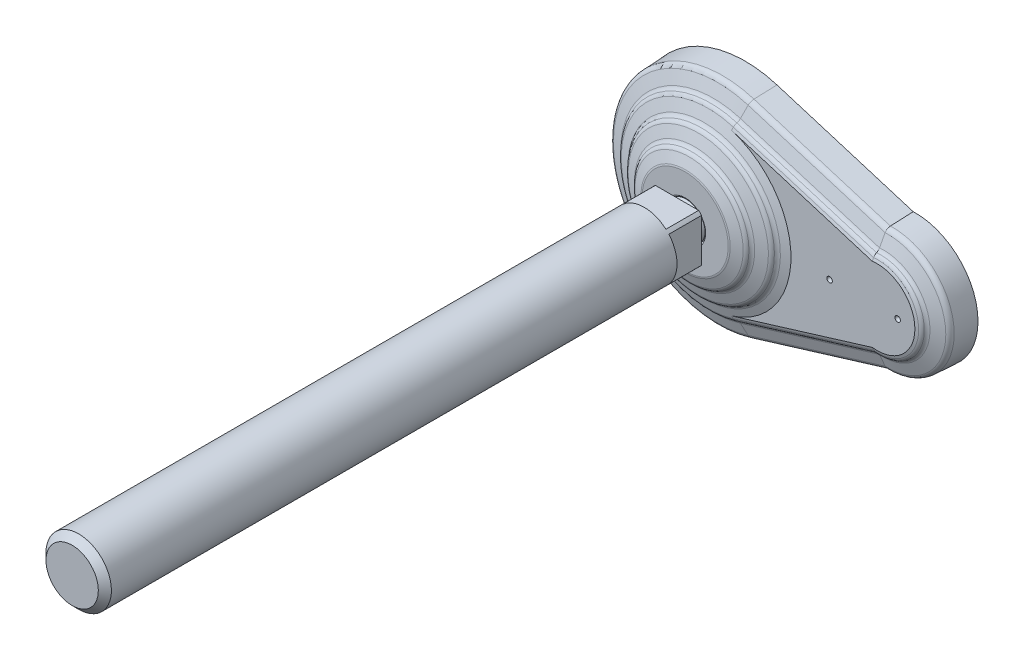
ISO-10303-21;
HEADER;
FILE_DESCRIPTION(('STEP AP214'),'2;1');
FILE_NAME('part.step','',(''),(''),'','','');
FILE_SCHEMA(('AUTOMOTIVE_DESIGN { 1 0 10303 214 1 1 1 1 }'));
ENDSEC;
DATA;
#1=APPLICATION_CONTEXT('core data for automotive mechanical design processes');
#2=APPLICATION_PROTOCOL_DEFINITION('international standard','automotive_design',2000,#1);
#3=PRODUCT_CONTEXT('',#1,'mechanical');
#4=PRODUCT('Part','Part','',(#3));
#5=PRODUCT_RELATED_PRODUCT_CATEGORY('part','',(#4));
#6=PRODUCT_DEFINITION_FORMATION('','',#4);
#7=PRODUCT_DEFINITION_CONTEXT('part definition',#1,'design');
#8=PRODUCT_DEFINITION('design','',#6,#7);
#9=PRODUCT_DEFINITION_SHAPE('','',#8);
#10=(LENGTH_UNIT() NAMED_UNIT(*) SI_UNIT(.MILLI.,.METRE.));
#11=(NAMED_UNIT(*) PLANE_ANGLE_UNIT() SI_UNIT($,.RADIAN.));
#12=(NAMED_UNIT(*) SI_UNIT($,.STERADIAN.) SOLID_ANGLE_UNIT());
#13=UNCERTAINTY_MEASURE_WITH_UNIT(LENGTH_MEASURE(1.E-05),#10,'distance_accuracy_value','');
#14=(GEOMETRIC_REPRESENTATION_CONTEXT(3) GLOBAL_UNCERTAINTY_ASSIGNED_CONTEXT((#13)) GLOBAL_UNIT_ASSIGNED_CONTEXT((#10,
#11,#12)) REPRESENTATION_CONTEXT('',''));
#15=CARTESIAN_POINT('',(0.,0.,0.));
#16=DIRECTION('',(0.,0.,1.));
#17=DIRECTION('',(1.,0.,0.));
#18=AXIS2_PLACEMENT_3D('',#15,#16,#17);
#19=CARTESIAN_POINT('',(0.,0.,37.));
#20=DIRECTION('',(0.,0.,1.));
#21=DIRECTION('',(-1.,0.,0.));
#22=AXIS2_PLACEMENT_3D('',#19,#20,#21);
#23=CYLINDRICAL_SURFACE('',#22,12.);
#24=CARTESIAN_POINT('',(0.,0.,244.6));
#25=DIRECTION('',(0.,0.,1.));
#26=DIRECTION('',(-1.,0.,0.));
#27=AXIS2_PLACEMENT_3D('',#24,#25,#26);
#28=CIRCLE('',#27,12.);
#29=CARTESIAN_POINT('',(-12.,0.,244.6));
#30=VERTEX_POINT('',#29);
#31=EDGE_CURVE('E9',#30,#30,#28,.F.);
#32=ORIENTED_EDGE('',*,*,#31,.T.);
#33=EDGE_LOOP('',(#32));
#34=FACE_BOUND('',#33,.T.);
#35=DIRECTION('',(0.,0.,1.));
#36=VECTOR('',#35,1.);
#37=CARTESIAN_POINT('',(-7.93725393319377,-9.,37.));
#38=LINE('',#37,#36);
#39=CARTESIAN_POINT('',(-7.93725393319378,-9.,37.));
#40=VERTEX_POINT('',#39);
#41=CARTESIAN_POINT('',(-7.93725393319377,-9.,25.));
#42=VERTEX_POINT('',#41);
#43=EDGE_CURVE('E135',#40,#42,#38,.F.);
#44=ORIENTED_EDGE('',*,*,#43,.F.);
#45=CARTESIAN_POINT('',(0.,0.,37.));
#46=DIRECTION('',(0.,0.,1.));
#47=DIRECTION('',(0.,-1.,0.));
#48=AXIS2_PLACEMENT_3D('',#45,#46,#47);
#49=CIRCLE('',#48,12.);
#50=CARTESIAN_POINT('',(7.93725393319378,-9.,37.));
#51=VERTEX_POINT('',#50);
#52=EDGE_CURVE('E506',#40,#51,#49,.T.);
#53=ORIENTED_EDGE('',*,*,#52,.T.);
#54=DIRECTION('',(0.,0.,1.));
#55=VECTOR('',#54,1.);
#56=CARTESIAN_POINT('',(7.93725393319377,-9.,37.));
#57=LINE('',#56,#55);
#58=CARTESIAN_POINT('',(7.93725393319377,-9.,25.));
#59=VERTEX_POINT('',#58);
#60=EDGE_CURVE('E200',#59,#51,#57,.T.);
#61=ORIENTED_EDGE('',*,*,#60,.F.);
#62=CARTESIAN_POINT('',(0.,0.,25.));
#63=DIRECTION('',(0.,0.,1.));
#64=DIRECTION('',(-1.,0.,0.));
#65=AXIS2_PLACEMENT_3D('',#62,#63,#64);
#66=CIRCLE('',#65,12.);
#67=CARTESIAN_POINT('',(9.,-7.93725393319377,25.));
#68=VERTEX_POINT('',#67);
#69=EDGE_CURVE('E183',#59,#68,#66,.T.);
#70=ORIENTED_EDGE('',*,*,#69,.T.);
#71=DIRECTION('',(0.,0.,1.));
#72=VECTOR('',#71,1.);
#73=CARTESIAN_POINT('',(9.,-7.93725393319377,37.));
#74=LINE('',#73,#72);
#75=CARTESIAN_POINT('',(9.,-7.93725393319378,37.));
#76=VERTEX_POINT('',#75);
#77=EDGE_CURVE('E197',#76,#68,#74,.F.);
#78=ORIENTED_EDGE('',*,*,#77,.F.);
#79=CARTESIAN_POINT('',(9.,7.93725393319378,37.));
#80=VERTEX_POINT('',#79);
#81=EDGE_CURVE('E265',#76,#80,#49,.T.);
#82=ORIENTED_EDGE('',*,*,#81,.T.);
#83=DIRECTION('',(0.,0.,1.));
#84=VECTOR('',#83,1.);
#85=CARTESIAN_POINT('',(9.,7.93725393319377,37.));
#86=LINE('',#85,#84);
#87=CARTESIAN_POINT('',(9.,7.93725393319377,25.));
#88=VERTEX_POINT('',#87);
#89=EDGE_CURVE('E242',#88,#80,#86,.T.);
#90=ORIENTED_EDGE('',*,*,#89,.F.);
#91=CARTESIAN_POINT('',(7.93725393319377,9.,25.));
#92=VERTEX_POINT('',#91);
#93=EDGE_CURVE('E179',#88,#92,#66,.T.);
#94=ORIENTED_EDGE('',*,*,#93,.T.);
#95=DIRECTION('',(0.,0.,1.));
#96=VECTOR('',#95,1.);
#97=CARTESIAN_POINT('',(7.93725393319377,9.,37.));
#98=LINE('',#97,#96);
#99=CARTESIAN_POINT('',(7.93725393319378,9.,37.));
#100=VERTEX_POINT('',#99);
#101=EDGE_CURVE('E160',#100,#92,#98,.F.);
#102=ORIENTED_EDGE('',*,*,#101,.F.);
#103=CARTESIAN_POINT('',(-7.93725393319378,9.,37.));
#104=VERTEX_POINT('',#103);
#105=EDGE_CURVE('E173',#100,#104,#49,.T.);
#106=ORIENTED_EDGE('',*,*,#105,.T.);
#107=DIRECTION('',(0.,0.,1.));
#108=VECTOR('',#107,1.);
#109=CARTESIAN_POINT('',(-7.93725393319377,9.,37.));
#110=LINE('',#109,#108);
#111=CARTESIAN_POINT('',(-7.93725393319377,9.,25.));
#112=VERTEX_POINT('',#111);
#113=EDGE_CURVE('E158',#112,#104,#110,.T.);
#114=ORIENTED_EDGE('',*,*,#113,.F.);
#115=CARTESIAN_POINT('',(-9.,7.93725393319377,25.));
#116=VERTEX_POINT('',#115);
#117=EDGE_CURVE('E171',#112,#116,#66,.T.);
#118=ORIENTED_EDGE('',*,*,#117,.T.);
#119=DIRECTION('',(0.,0.,1.));
#120=VECTOR('',#119,1.);
#121=CARTESIAN_POINT('',(-9.,7.93725393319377,37.));
#122=LINE('',#121,#120);
#123=CARTESIAN_POINT('',(-9.,7.93725393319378,37.));
#124=VERTEX_POINT('',#123);
#125=EDGE_CURVE('E174',#124,#116,#122,.F.);
#126=ORIENTED_EDGE('',*,*,#125,.F.);
#127=CARTESIAN_POINT('',(-9.,-7.93725393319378,37.));
#128=VERTEX_POINT('',#127);
#129=EDGE_CURVE('E516',#124,#128,#49,.T.);
#130=ORIENTED_EDGE('',*,*,#129,.T.);
#131=DIRECTION('',(0.,0.,1.));
#132=VECTOR('',#131,1.);
#133=CARTESIAN_POINT('',(-9.,-7.93725393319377,37.));
#134=LINE('',#133,#132);
#135=CARTESIAN_POINT('',(-9.,-7.93725393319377,25.));
#136=VERTEX_POINT('',#135);
#137=EDGE_CURVE('E180',#136,#128,#134,.T.);
#138=ORIENTED_EDGE('',*,*,#137,.F.);
#139=EDGE_CURVE('E182',#136,#42,#66,.T.);
#140=ORIENTED_EDGE('',*,*,#139,.T.);
#141=EDGE_LOOP('',(#44,#53,#61,#70,#78,#82,#90,#94,#102,#106,#114,#118,#126,#130,#138,#140));
#142=FACE_BOUND('',#141,.T.);
#143=ADVANCED_FACE('F14',(#34,#142),#23,.T.);
#144=CARTESIAN_POINT('',(-5.26544933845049,0.,25.));
#145=DIRECTION('',(0.,0.,1.));
#146=DIRECTION('',(-1.,0.,0.));
#147=AXIS2_PLACEMENT_3D('',#144,#145,#146);
#148=PLANE('',#147);
#149=DIRECTION('',(0.,-1.,0.));
#150=VECTOR('',#149,1.);
#151=CARTESIAN_POINT('',(-9.,9.,25.));
#152=LINE('',#151,#150);
#153=EDGE_CURVE('E31',#116,#136,#152,.T.);
#154=ORIENTED_EDGE('',*,*,#153,.F.);
#155=ORIENTED_EDGE('',*,*,#117,.F.);
#156=DIRECTION('',(-1.,0.,0.));
#157=VECTOR('',#156,1.);
#158=CARTESIAN_POINT('',(9.,9.,25.));
#159=LINE('',#158,#157);
#160=EDGE_CURVE('E153',#92,#112,#159,.T.);
#161=ORIENTED_EDGE('',*,*,#160,.F.);
#162=ORIENTED_EDGE('',*,*,#93,.F.);
#163=DIRECTION('',(0.,1.,0.));
#164=VECTOR('',#163,1.);
#165=CARTESIAN_POINT('',(9.,-9.,25.));
#166=LINE('',#165,#164);
#167=EDGE_CURVE('E165',#68,#88,#166,.T.);
#168=ORIENTED_EDGE('',*,*,#167,.F.);
#169=ORIENTED_EDGE('',*,*,#69,.F.);
#170=DIRECTION('',(1.,0.,0.));
#171=VECTOR('',#170,1.);
#172=CARTESIAN_POINT('',(-9.,-9.,25.));
#173=LINE('',#172,#171);
#174=EDGE_CURVE('E202',#42,#59,#173,.T.);
#175=ORIENTED_EDGE('',*,*,#174,.F.);
#176=ORIENTED_EDGE('',*,*,#139,.F.);
#177=EDGE_LOOP('',(#154,#155,#161,#162,#168,#169,#175,#176));
#178=FACE_BOUND('',#177,.T.);
#179=CARTESIAN_POINT('',(0.,0.,25.));
#180=DIRECTION('',(0.,0.,1.));
#181=DIRECTION('',(-1.,0.,0.));
#182=AXIS2_PLACEMENT_3D('',#179,#180,#181);
#183=CIRCLE('',#182,5.26544933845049);
#184=CARTESIAN_POINT('',(-5.26544933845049,0.,25.));
#185=VERTEX_POINT('',#184);
#186=EDGE_CURVE('E188',#185,#185,#183,.T.);
#187=ORIENTED_EDGE('',*,*,#186,.T.);
#188=EDGE_LOOP('',(#187));
#189=FACE_BOUND('',#188,.T.);
#190=ADVANCED_FACE('F176',(#178,#189),#148,.F.);
#191=CARTESIAN_POINT('',(0.,0.,18.6509999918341));
#192=DIRECTION('',(0.,0.,1.));
#193=DIRECTION('',(-1.,0.,0.));
#194=AXIS2_PLACEMENT_3D('',#191,#192,#193);
#195=DEGENERATE_TOROIDAL_SURFACE('',#194,0.000333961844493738,6.829,.T.);
#196=CARTESIAN_POINT('',(0.,0.,19.794));
#197=DIRECTION('',(0.,0.,-1.));
#198=DIRECTION('',(1.,0.,0.));
#199=AXIS2_PLACEMENT_3D('',#196,#197,#198);
#200=CIRCLE('',#199,6.733);
#201=CARTESIAN_POINT('',(6.733,0.,19.794));
#202=VERTEX_POINT('',#201);
#203=EDGE_CURVE('E249',#202,#202,#200,.T.);
#204=ORIENTED_EDGE('',*,*,#203,.F.);
#205=EDGE_LOOP('',(#204));
#206=FACE_BOUND('',#205,.T.);
#207=CARTESIAN_POINT('',(0.,0.,23.));
#208=DIRECTION('',(0.,0.,1.));
#209=DIRECTION('',(-1.,0.,0.));
#210=AXIS2_PLACEMENT_3D('',#207,#208,#209);
#211=CIRCLE('',#210,5.2654493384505);
#212=CARTESIAN_POINT('',(-5.2654493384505,0.,23.));
#213=VERTEX_POINT('',#212);
#214=EDGE_CURVE('E190',#213,#213,#211,.T.);
#215=ORIENTED_EDGE('',*,*,#214,.F.);
#216=EDGE_LOOP('',(#215));
#217=FACE_BOUND('',#216,.T.);
#218=ADVANCED_FACE('F450',(#206,#217),#195,.T.);
#219=CARTESIAN_POINT('',(0.,0.,37.));
#220=DIRECTION('',(0.,0.,1.));
#221=DIRECTION('',(-1.,0.,0.));
#222=AXIS2_PLACEMENT_3D('',#219,#220,#221);
#223=CYLINDRICAL_SURFACE('',#222,5.2654493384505);
#224=ORIENTED_EDGE('',*,*,#186,.F.);
#225=EDGE_LOOP('',(#224));
#226=FACE_BOUND('',#225,.T.);
#227=ORIENTED_EDGE('',*,*,#214,.T.);
#228=EDGE_LOOP('',(#227));
#229=FACE_BOUND('',#228,.T.);
#230=ADVANCED_FACE('F529',(#226,#229),#223,.T.);
#231=CARTESIAN_POINT('',(-9.,-9.,25.));
#232=DIRECTION('',(0.,-1.,0.));
#233=DIRECTION('',(1.,0.,0.));
#234=AXIS2_PLACEMENT_3D('',#231,#232,#233);
#235=PLANE('',#234);
#236=ORIENTED_EDGE('',*,*,#60,.T.);
#237=DIRECTION('',(-1.,0.,0.));
#238=VECTOR('',#237,1.);
#239=CARTESIAN_POINT('',(-12.,-9.,37.));
#240=LINE('',#239,#238);
#241=EDGE_CURVE('E214',#51,#40,#240,.T.);
#242=ORIENTED_EDGE('',*,*,#241,.T.);
#243=ORIENTED_EDGE('',*,*,#43,.T.);
#244=ORIENTED_EDGE('',*,*,#174,.T.);
#245=EDGE_LOOP('',(#236,#242,#243,#244));
#246=FACE_BOUND('',#245,.T.);
#247=ADVANCED_FACE('F525',(#246),#235,.T.);
#248=CARTESIAN_POINT('',(9.,-9.,25.));
#249=DIRECTION('',(1.,0.,0.));
#250=DIRECTION('',(0.,1.,0.));
#251=AXIS2_PLACEMENT_3D('',#248,#249,#250);
#252=PLANE('',#251);
#253=ORIENTED_EDGE('',*,*,#89,.T.);
#254=DIRECTION('',(0.,-1.,0.));
#255=VECTOR('',#254,1.);
#256=CARTESIAN_POINT('',(9.,0.,37.));
#257=LINE('',#256,#255);
#258=EDGE_CURVE('E221',#80,#76,#257,.T.);
#259=ORIENTED_EDGE('',*,*,#258,.T.);
#260=ORIENTED_EDGE('',*,*,#77,.T.);
#261=ORIENTED_EDGE('',*,*,#167,.T.);
#262=EDGE_LOOP('',(#253,#259,#260,#261));
#263=FACE_BOUND('',#262,.T.);
#264=ADVANCED_FACE('F540',(#263),#252,.T.);
#265=CARTESIAN_POINT('',(9.,9.,25.));
#266=DIRECTION('',(0.,1.,0.));
#267=DIRECTION('',(-1.,0.,0.));
#268=AXIS2_PLACEMENT_3D('',#265,#266,#267);
#269=PLANE('',#268);
#270=ORIENTED_EDGE('',*,*,#113,.T.);
#271=DIRECTION('',(1.,0.,0.));
#272=VECTOR('',#271,1.);
#273=CARTESIAN_POINT('',(-12.,9.,37.));
#274=LINE('',#273,#272);
#275=EDGE_CURVE('E225',#104,#100,#274,.T.);
#276=ORIENTED_EDGE('',*,*,#275,.T.);
#277=ORIENTED_EDGE('',*,*,#101,.T.);
#278=ORIENTED_EDGE('',*,*,#160,.T.);
#279=EDGE_LOOP('',(#270,#276,#277,#278));
#280=FACE_BOUND('',#279,.T.);
#281=ADVANCED_FACE('F155',(#280),#269,.T.);
#282=CARTESIAN_POINT('',(-9.,9.,25.));
#283=DIRECTION('',(-1.,0.,0.));
#284=DIRECTION('',(0.,-1.,0.));
#285=AXIS2_PLACEMENT_3D('',#282,#283,#284);
#286=PLANE('',#285);
#287=ORIENTED_EDGE('',*,*,#137,.T.);
#288=DIRECTION('',(0.,1.,0.));
#289=VECTOR('',#288,1.);
#290=CARTESIAN_POINT('',(-9.,0.,37.));
#291=LINE('',#290,#289);
#292=EDGE_CURVE('E238',#128,#124,#291,.T.);
#293=ORIENTED_EDGE('',*,*,#292,.T.);
#294=ORIENTED_EDGE('',*,*,#125,.T.);
#295=ORIENTED_EDGE('',*,*,#153,.T.);
#296=EDGE_LOOP('',(#287,#293,#294,#295));
#297=FACE_BOUND('',#296,.T.);
#298=ADVANCED_FACE('F461',(#297),#286,.T.);
#299=CARTESIAN_POINT('',(62.5,0.,0.));
#300=DIRECTION('',(0.,0.,-1.));
#301=DIRECTION('',(0.,1.,0.));
#302=AXIS2_PLACEMENT_3D('',#299,#300,#301);
#303=CONICAL_SURFACE('',#302,22.9787234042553,0.0523365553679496);
#304=CARTESIAN_POINT('',(62.5,0.,8.30411735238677));
#305=DIRECTION('',(0.,0.,1.));
#306=DIRECTION('',(0.,-1.,0.));
#307=AXIS2_PLACEMENT_3D('',#304,#305,#306);
#308=CIRCLE('',#307,22.5437172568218);
#309=CARTESIAN_POINT('',(61.6407011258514,-22.5273343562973,8.30411735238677));
#310=VERTEX_POINT('',#309);
#311=CARTESIAN_POINT('',(61.6407011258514,22.5273343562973,8.30411735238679));
#312=VERTEX_POINT('',#311);
#313=EDGE_CURVE('E284',#310,#312,#308,.T.);
#314=ORIENTED_EDGE('',*,*,#313,.F.);
#315=CARTESIAN_POINT('',(61.6406997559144,-22.5273238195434,8.30431735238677));
#316=CARTESIAN_POINT('',(61.6501805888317,-22.600242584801,6.92023165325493));
#317=CARTESIAN_POINT('',(61.6596900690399,-22.6731526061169,5.53614569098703));
#318=CARTESIAN_POINT('',(61.6787663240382,-22.8189551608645,2.76797324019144));
#319=CARTESIAN_POINT('',(61.6883330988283,-22.8918476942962,1.38388675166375));
#320=CARTESIAN_POINT('',(61.6979285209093,-22.9647314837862,-0.00020000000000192));
#321=B_SPLINE_CURVE_WITH_KNOTS('',3,(#315,#316,#317,#318,#319,#320),.UNSPECIFIED.,.F.,.F.,(4,2,
4),(0.,4.15811282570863,8.31622565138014),.UNSPECIFIED.);
#322=CARTESIAN_POINT('',(61.697927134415,-22.9647209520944,0.));
#323=VERTEX_POINT('',#322);
#324=EDGE_CURVE('E691',#310,#323,#321,.T.);
#325=ORIENTED_EDGE('',*,*,#324,.T.);
#326=CARTESIAN_POINT('',(62.5,0.,0.));
#327=DIRECTION('',(0.,0.,1.));
#328=DIRECTION('',(0.,-1.,0.));
#329=AXIS2_PLACEMENT_3D('',#326,#327,#328);
#330=CIRCLE('',#329,22.9787234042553);
#331=CARTESIAN_POINT('',(61.6979271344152,22.9647209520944,0.));
#332=VERTEX_POINT('',#331);
#333=EDGE_CURVE('E286',#323,#332,#330,.T.);
#334=ORIENTED_EDGE('',*,*,#333,.T.);
#335=CARTESIAN_POINT('',(61.6979285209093,22.9647314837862,-0.00019999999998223));
#336=CARTESIAN_POINT('',(61.6883330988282,22.8918476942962,1.38388675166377));
#337=CARTESIAN_POINT('',(61.6787663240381,22.8189551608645,2.76797324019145));
#338=CARTESIAN_POINT('',(61.6596900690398,22.6731526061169,5.53614569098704));
#339=CARTESIAN_POINT('',(61.6501805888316,22.600242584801,6.92023165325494));
#340=CARTESIAN_POINT('',(61.6406997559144,22.5273238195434,8.30431735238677));
#341=B_SPLINE_CURVE_WITH_KNOTS('',3,(#335,#336,#337,#338,#339,#340),.UNSPECIFIED.,.F.,.F.,(4,2,
4),(0.,4.1581128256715,8.31622565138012),.UNSPECIFIED.);
#342=EDGE_CURVE('E700',#332,#312,#341,.T.);
#343=ORIENTED_EDGE('',*,*,#342,.T.);
#344=EDGE_LOOP('',(#314,#325,#334,#343));
#345=FACE_BOUND('',#344,.T.);
#346=ADVANCED_FACE('F455',(#345),#303,.T.);
#347=CARTESIAN_POINT('',(64.1644462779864,-21.755748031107,8.30411735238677));
#348=DIRECTION('',(-0.291971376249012,0.9549953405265,-0.0523126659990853));
#349=DIRECTION('',(-0.956304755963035,-0.292371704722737,0.));
#350=AXIS2_PLACEMENT_3D('',#347,#348,#349);
#351=PLANE('',#350);
#352=ORIENTED_EDGE('',*,*,#324,.F.);
#353=DIRECTION('',(-0.956304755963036,-0.292371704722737,0.));
#354=VECTOR('',#353,1.);
#355=CARTESIAN_POINT('',(64.1644462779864,-21.755748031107,8.30411735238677));
#356=LINE('',#355,#354);
#357=CARTESIAN_POINT('',(11.5676847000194,-37.8361917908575,8.30411735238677));
#358=VERTEX_POINT('',#357);
#359=EDGE_CURVE('E620',#310,#358,#356,.T.);
#360=ORIENTED_EDGE('',*,*,#359,.T.);
#361=DIRECTION('',(-0.0152947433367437,0.050026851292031,0.998630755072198));
#362=VECTOR('',#361,1.);
#363=CARTESIAN_POINT('',(11.6948681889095,-38.2521902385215,0.));
#364=LINE('',#363,#362);
#365=CARTESIAN_POINT('',(11.6948681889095,-38.2521902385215,0.));
#366=VERTEX_POINT('',#365);
#367=EDGE_CURVE('E633',#366,#358,#364,.T.);
#368=ORIENTED_EDGE('',*,*,#367,.F.);
#369=DIRECTION('',(-0.956304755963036,-0.292371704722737,0.));
#370=VECTOR('',#369,1.);
#371=CARTESIAN_POINT('',(64.2916297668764,-22.1717464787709,0.));
#372=LINE('',#371,#370);
#373=EDGE_CURVE('E126',#323,#366,#372,.T.);
#374=ORIENTED_EDGE('',*,*,#373,.F.);
#375=EDGE_LOOP('',(#352,#360,#368,#374));
#376=FACE_BOUND('',#375,.T.);
#377=ADVANCED_FACE('F446',(#376),#351,.F.);
#378=CARTESIAN_POINT('',(0.,0.,0.));
#379=DIRECTION('',(0.,0.,1.));
#380=DIRECTION('',(-1.,0.,0.));
#381=AXIS2_PLACEMENT_3D('',#378,#379,#380);
#382=PLANE('',#381);
#383=DIRECTION('',(-0.956304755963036,0.292371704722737,0.));
#384=VECTOR('',#383,1.);
#385=CARTESIAN_POINT('',(64.2916297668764,22.1717464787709,0.));
#386=LINE('',#385,#384);
#387=CARTESIAN_POINT('',(11.6948681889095,38.2521902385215,0.));
#388=VERTEX_POINT('',#387);
#389=EDGE_CURVE('E618',#332,#388,#386,.T.);
#390=ORIENTED_EDGE('',*,*,#389,.F.);
#391=ORIENTED_EDGE('',*,*,#333,.F.);
#392=ORIENTED_EDGE('',*,*,#373,.T.);
#393=CARTESIAN_POINT('',(0.,0.,0.));
#394=DIRECTION('',(0.,0.,1.));
#395=DIRECTION('',(-1.,0.,0.));
#396=AXIS2_PLACEMENT_3D('',#393,#394,#395);
#397=CIRCLE('',#396,40.);
#398=EDGE_CURVE('E327',#388,#366,#397,.T.);
#399=ORIENTED_EDGE('',*,*,#398,.F.);
#400=EDGE_LOOP('',(#390,#391,#392,#399));
#401=FACE_BOUND('',#400,.T.);
#402=CARTESIAN_POINT('',(45.,0.,0.));
#403=DIRECTION('',(0.,0.,-1.));
#404=DIRECTION('',(0.,1.,0.));
#405=AXIS2_PLACEMENT_3D('',#402,#403,#404);
#406=CIRCLE('',#405,5.25);
#407=CARTESIAN_POINT('',(45.,5.25,0.));
#408=VERTEX_POINT('',#407);
#409=EDGE_CURVE('E503',#408,#408,#406,.T.);
#410=ORIENTED_EDGE('',*,*,#409,.F.);
#411=EDGE_LOOP('',(#410));
#412=FACE_BOUND('',#411,.T.);
#413=CARTESIAN_POINT('',(70.,0.,0.));
#414=DIRECTION('',(0.,0.,-1.));
#415=DIRECTION('',(0.,1.,0.));
#416=AXIS2_PLACEMENT_3D('',#413,#414,#415);
#417=CIRCLE('',#416,5.25);
#418=CARTESIAN_POINT('',(70.,5.25,0.));
#419=VERTEX_POINT('',#418);
#420=EDGE_CURVE('E500',#419,#419,#417,.T.);
#421=ORIENTED_EDGE('',*,*,#420,.F.);
#422=EDGE_LOOP('',(#421));
#423=FACE_BOUND('',#422,.T.);
#424=ADVANCED_FACE('F336',(#401,#412,#423),#382,.F.);
#425=CARTESIAN_POINT('',(64.2916297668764,22.1717464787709,0.));
#426=DIRECTION('',(-0.291971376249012,-0.9549953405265,-0.0523126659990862));
#427=DIRECTION('',(0.956304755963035,-0.292371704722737,0.));
#428=AXIS2_PLACEMENT_3D('',#425,#426,#427);
#429=PLANE('',#428);
#430=ORIENTED_EDGE('',*,*,#342,.F.);
#431=ORIENTED_EDGE('',*,*,#389,.T.);
#432=DIRECTION('',(-0.0152947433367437,-0.050026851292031,0.998630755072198));
#433=VECTOR('',#432,1.);
#434=CARTESIAN_POINT('',(11.6948681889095,38.2521902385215,0.));
#435=LINE('',#434,#433);
#436=CARTESIAN_POINT('',(11.5676847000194,37.8361917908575,8.30411735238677));
#437=VERTEX_POINT('',#436);
#438=EDGE_CURVE('E651',#388,#437,#435,.T.);
#439=ORIENTED_EDGE('',*,*,#438,.T.);
#440=DIRECTION('',(-0.956304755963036,0.292371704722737,0.));
#441=VECTOR('',#440,1.);
#442=CARTESIAN_POINT('',(64.1644462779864,21.755748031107,8.30411735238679));
#443=LINE('',#442,#441);
#444=EDGE_CURVE('E616',#312,#437,#443,.T.);
#445=ORIENTED_EDGE('',*,*,#444,.F.);
#446=EDGE_LOOP('',(#430,#431,#439,#445));
#447=FACE_BOUND('',#446,.T.);
#448=ADVANCED_FACE('F416',(#447),#429,.F.);
#449=CARTESIAN_POINT('',(62.5,0.,8.19912580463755));
#450=DIRECTION('',(0.,0.,1.));
#451=DIRECTION('',(0.,-1.,0.));
#452=AXIS2_PLACEMENT_3D('',#449,#450,#451);
#453=TOROIDAL_SURFACE('',#452,20.5394653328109,2.007);
#454=CARTESIAN_POINT('',(61.6407233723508,-22.5275054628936,8.09743405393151));
#455=CARTESIAN_POINT('',(61.6409510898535,-22.5292569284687,8.13179934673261));
#456=CARTESIAN_POINT('',(61.6410635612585,-22.5301219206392,8.16619641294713));
#457=CARTESIAN_POINT('',(61.6410572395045,-22.5300732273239,8.23504586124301));
#458=CARTESIAN_POINT('',(61.6409380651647,-22.5291566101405,8.26949824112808));
#459=CARTESIAN_POINT('',(61.6399396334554,-22.5214778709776,8.41537858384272));
#460=CARTESIAN_POINT('',(61.6379561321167,-22.5062239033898,8.52649092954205));
#461=CARTESIAN_POINT('',(61.6316126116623,-22.4573679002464,8.74462326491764));
#462=CARTESIAN_POINT('',(61.6272490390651,-22.4237384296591,8.85163687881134));
#463=CARTESIAN_POINT('',(61.6163034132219,-22.339189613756,9.05835724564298));
#464=CARTESIAN_POINT('',(61.6097238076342,-22.2882893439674,9.1580719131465));
#465=CARTESIAN_POINT('',(61.5945702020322,-22.1707054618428,9.34754679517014));
#466=CARTESIAN_POINT('',(61.5859960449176,-22.1040206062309,9.43730622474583));
#467=CARTESIAN_POINT('',(61.5670698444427,-21.9562760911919,9.60507832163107));
#468=CARTESIAN_POINT('',(61.5567047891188,-21.8751110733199,9.68299656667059));
#469=CARTESIAN_POINT('',(61.5345911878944,-21.7011851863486,9.82410142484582));
#470=CARTESIAN_POINT('',(61.5228449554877,-21.6084436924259,9.88731215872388));
#471=CARTESIAN_POINT('',(61.5046129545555,-21.4637836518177,9.96928669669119));
#472=CARTESIAN_POINT('',(61.4985079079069,-21.4152343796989,9.99425235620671));
#473=CARTESIAN_POINT('',(61.4860940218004,-21.3162718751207,10.0401972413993));
#474=CARTESIAN_POINT('',(61.4797850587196,-21.2658575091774,10.0611739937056));
#475=CARTESIAN_POINT('',(61.4596293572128,-21.1043762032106,10.1208327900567));
#476=CARTESIAN_POINT('',(61.4454888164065,-20.9904779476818,10.1519983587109));
#477=CARTESIAN_POINT('',(61.4169436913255,-20.7591475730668,10.1941665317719));
#478=CARTESIAN_POINT('',(61.4025394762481,-20.6417202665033,10.2051954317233));
#479=CARTESIAN_POINT('',(61.3876252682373,-20.5193667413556,10.2061070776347));
#480=CARTESIAN_POINT('',(61.3870090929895,-20.5143103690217,10.2061258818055));
#481=CARTESIAN_POINT('',(61.3863931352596,-20.5092543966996,10.2061258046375));
#482=B_SPLINE_CURVE_WITH_KNOTS('',3,(#454,#455,#456,#457,#458,#459,#460,#461,#462,#463,#464,
#465,#466,#467,#468,#469,#470,#471,#472,#473,#474,#475,#476,#477,#478,#479,#480,#481),
.UNSPECIFIED.,.F.,.F.,(4,2,2,2,2,2,2,2,2,2,2,2,2,4),(0.,0.103191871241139,0.20655369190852,
0.54127575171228,0.87649892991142,1.21135305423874,1.54623356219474,1.88365820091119,
2.2205254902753,2.38517216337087,2.54992059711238,2.90486008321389,3.2593357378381,
3.2746170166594),.UNSPECIFIED.);
#483=CARTESIAN_POINT('',(61.4734629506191,-21.2152067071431,10.0798866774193));
#484=VERTEX_POINT('',#483);
#485=EDGE_CURVE('E693',#310,#484,#482,.T.);
#486=ORIENTED_EDGE('',*,*,#485,.F.);
#487=ORIENTED_EDGE('',*,*,#313,.T.);
#488=CARTESIAN_POINT('',(61.3863931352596,20.5092543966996,10.2061258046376));
#489=CARTESIAN_POINT('',(61.3870091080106,20.5143104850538,10.2061258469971));
#490=CARTESIAN_POINT('',(61.3876252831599,20.5193668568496,10.206107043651));
#491=CARTESIAN_POINT('',(61.3988855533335,20.6117442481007,10.2054193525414));
#492=CARTESIAN_POINT('',(61.4095840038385,20.6991031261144,10.1991511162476));
#493=CARTESIAN_POINT('',(61.4308936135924,20.8723273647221,10.1754412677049));
#494=CARTESIAN_POINT('',(61.4415047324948,20.9581920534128,10.1579947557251));
#495=CARTESIAN_POINT('',(61.4555813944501,21.0716202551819,10.1272225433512));
#496=CARTESIAN_POINT('',(61.4591730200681,21.1005182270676,10.1186877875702));
#497=CARTESIAN_POINT('',(61.4663157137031,21.1579059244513,10.1003430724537));
#498=CARTESIAN_POINT('',(61.4698667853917,21.1863956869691,10.090533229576));
#499=CARTESIAN_POINT('',(61.4866782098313,21.3210820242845,10.0407628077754));
#500=CARTESIAN_POINT('',(61.4996430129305,21.4243838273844,9.99241683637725));
#501=CARTESIAN_POINT('',(61.5245148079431,21.6216549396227,9.87891981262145));
#502=CARTESIAN_POINT('',(61.5364193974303,21.7156031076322,9.81373183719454));
#503=CARTESIAN_POINT('',(61.5587594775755,21.8912250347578,9.66834297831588));
#504=CARTESIAN_POINT('',(61.5691956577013,21.9729045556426,9.58814918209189));
#505=CARTESIAN_POINT('',(61.5882470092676,22.1215501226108,9.41495435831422));
#506=CARTESIAN_POINT('',(61.5968625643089,22.1885192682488,9.32195603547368));
#507=CARTESIAN_POINT('',(61.6119005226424,22.3051440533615,9.12674801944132));
#508=CARTESIAN_POINT('',(61.6183432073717,22.3549598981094,9.02463544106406));
#509=CARTESIAN_POINT('',(61.6289130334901,22.4365717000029,8.81343456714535));
#510=CARTESIAN_POINT('',(61.6330436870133,22.4683949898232,8.70435713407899));
#511=CARTESIAN_POINT('',(61.6371976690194,22.5003783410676,8.54571963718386));
#512=CARTESIAN_POINT('',(61.6382205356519,22.5082502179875,8.49762935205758));
#513=CARTESIAN_POINT('',(61.639806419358,22.5204527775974,8.40103137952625));
#514=CARTESIAN_POINT('',(61.6403698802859,22.52478687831,8.35252414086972));
#515=CARTESIAN_POINT('',(61.6411729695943,22.5309631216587,8.23516417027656));
#516=CARTESIAN_POINT('',(61.641181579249,22.5310278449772,8.16621181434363));
#517=CARTESIAN_POINT('',(61.6407233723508,22.5275054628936,8.09743405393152));
#518=B_SPLINE_CURVE_WITH_KNOTS('',3,(#488,#489,#490,#491,#492,#493,#494,#495,#496,#497,#498,
#499,#500,#501,#502,#503,#504,#505,#506,#507,#508,#509,#510,#511,#512,#513,#514,#515,#516,#517),
.UNSPECIFIED.,.F.,.F.,(4,2,2,2,2,2,2,2,2,2,2,2,2,2,4),(0.,0.0152812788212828,0.27917431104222,
0.543183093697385,0.634194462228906,0.725197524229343,1.06775959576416,1.41107914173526,
1.75423694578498,2.09732237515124,2.43711059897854,2.77638125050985,2.92250118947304,
3.06847978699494,3.27496314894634),.UNSPECIFIED.);
#519=CARTESIAN_POINT('',(61.4734629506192,21.2152067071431,10.0798866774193));
#520=VERTEX_POINT('',#519);
#521=EDGE_CURVE('E405',#520,#312,#518,.T.);
#522=ORIENTED_EDGE('',*,*,#521,.F.);
#523=CARTESIAN_POINT('',(62.5,0.,10.0798866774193));
#524=DIRECTION('',(0.,0.,1.));
#525=DIRECTION('',(0.,-1.,0.));
#526=AXIS2_PLACEMENT_3D('',#523,#524,#525);
#527=CIRCLE('',#526,21.2400276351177);
#528=EDGE_CURVE('E282',#484,#520,#527,.T.);
#529=ORIENTED_EDGE('',*,*,#528,.F.);
#530=EDGE_LOOP('',(#486,#487,#522,#529));
#531=FACE_BOUND('',#530,.T.);
#532=ADVANCED_FACE('F387',(#531),#453,.T.);
#533=CARTESIAN_POINT('',(63.5784597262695,-19.8390723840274,8.19912580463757));
#534=DIRECTION('',(-0.956304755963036,-0.292371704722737,0.));
#535=DIRECTION('',(0.292371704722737,-0.956304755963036,0.));
#536=AXIS2_PLACEMENT_3D('',#533,#534,#535);
#537=CYLINDRICAL_SURFACE('',#536,2.00699999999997);
#538=ORIENTED_EDGE('',*,*,#359,.F.);
#539=ORIENTED_EDGE('',*,*,#485,.T.);
#540=DIRECTION('',(-0.956304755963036,-0.292371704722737,0.));
#541=VECTOR('',#540,1.);
#542=CARTESIAN_POINT('',(63.7832843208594,-20.5090234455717,10.0798866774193));
#543=LINE('',#542,#541);
#544=CARTESIAN_POINT('',(11.1865227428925,-36.5894672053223,10.0798866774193));
#545=VERTEX_POINT('',#544);
#546=EDGE_CURVE('E622',#484,#545,#543,.T.);
#547=ORIENTED_EDGE('',*,*,#546,.T.);
#548=CARTESIAN_POINT('',(10.9816981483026,-35.9195161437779,8.19912580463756));
#549=DIRECTION('',(0.956304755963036,0.292371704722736,0.));
#550=DIRECTION('',(-0.292371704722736,0.956304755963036,0.));
#551=AXIS2_PLACEMENT_3D('',#548,#549,#550);
#552=CIRCLE('',#551,2.007);
#553=EDGE_CURVE('E636',#545,#358,#552,.T.);
#554=ORIENTED_EDGE('',*,*,#553,.T.);
#555=EDGE_LOOP('',(#538,#539,#547,#554));
#556=FACE_BOUND('',#555,.T.);
#557=ADVANCED_FACE('F417',(#556),#537,.T.);
#558=CARTESIAN_POINT('',(0.,0.,0.));
#559=DIRECTION('',(0.,0.,-1.));
#560=DIRECTION('',(1.,0.,0.));
#561=AXIS2_PLACEMENT_3D('',#558,#559,#560);
#562=CONICAL_SURFACE('',#561,40.,0.0523365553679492);
#563=CARTESIAN_POINT('',(0.,0.,8.30411735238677));
#564=DIRECTION('',(0.,0.,1.));
#565=DIRECTION('',(-1.,0.,0.));
#566=AXIS2_PLACEMENT_3D('',#563,#564,#565);
#567=CIRCLE('',#566,39.5649938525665);
#568=EDGE_CURVE('E680',#437,#358,#567,.T.);
#569=ORIENTED_EDGE('',*,*,#568,.F.);
#570=ORIENTED_EDGE('',*,*,#438,.F.);
#571=ORIENTED_EDGE('',*,*,#398,.T.);
#572=ORIENTED_EDGE('',*,*,#367,.T.);
#573=EDGE_LOOP('',(#569,#570,#571,#572));
#574=FACE_BOUND('',#573,.T.);
#575=ADVANCED_FACE('F437',(#574),#562,.T.);
#576=CARTESIAN_POINT('',(63.5784597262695,19.8390723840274,8.1991258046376));
#577=DIRECTION('',(-0.956304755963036,0.292371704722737,0.));
#578=DIRECTION('',(-0.292371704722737,-0.956304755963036,0.));
#579=AXIS2_PLACEMENT_3D('',#576,#577,#578);
#580=CYLINDRICAL_SURFACE('',#579,2.00699999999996);
#581=DIRECTION('',(-0.956304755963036,0.292371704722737,0.));
#582=VECTOR('',#581,1.);
#583=CARTESIAN_POINT('',(63.7832843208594,20.5090234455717,10.0798866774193));
#584=LINE('',#583,#582);
#585=CARTESIAN_POINT('',(11.1865227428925,36.5894672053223,10.0798866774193));
#586=VERTEX_POINT('',#585);
#587=EDGE_CURVE('E614',#520,#586,#584,.T.);
#588=ORIENTED_EDGE('',*,*,#587,.F.);
#589=ORIENTED_EDGE('',*,*,#521,.T.);
#590=ORIENTED_EDGE('',*,*,#444,.T.);
#591=CARTESIAN_POINT('',(10.9816981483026,35.9195161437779,8.19912580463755));
#592=DIRECTION('',(-0.956304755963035,0.292371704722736,0.));
#593=DIRECTION('',(-0.292371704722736,-0.956304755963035,0.));
#594=AXIS2_PLACEMENT_3D('',#591,#592,#593);
#595=CIRCLE('',#594,2.007);
#596=EDGE_CURVE('E654',#586,#437,#595,.T.);
#597=ORIENTED_EDGE('',*,*,#596,.F.);
#598=EDGE_LOOP('',(#588,#589,#590,#597));
#599=FACE_BOUND('',#598,.T.);
#600=ADVANCED_FACE('F345',(#599),#580,.T.);
#601=CARTESIAN_POINT('',(62.5,0.,10.0798866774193));
#602=DIRECTION('',(0.,0.,-1.));
#603=DIRECTION('',(0.,1.,0.));
#604=AXIS2_PLACEMENT_3D('',#601,#602,#603);
#605=CONICAL_SURFACE('',#604,21.2400276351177,1.21422909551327);
#606=CARTESIAN_POINT('',(62.5,0.,11.656251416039));
#607=DIRECTION('',(0.,0.,1.));
#608=DIRECTION('',(0.,-1.,0.));
#609=AXIS2_PLACEMENT_3D('',#606,#607,#608);
#610=CIRCLE('',#609,17.0080484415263);
#611=CARTESIAN_POINT('',(60.9818619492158,-16.9401584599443,11.656251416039));
#612=VERTEX_POINT('',#611);
#613=CARTESIAN_POINT('',(60.9818619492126,16.9401584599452,11.656251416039));
#614=VERTEX_POINT('',#613);
#615=EDGE_CURVE('E280',#612,#614,#610,.T.);
#616=ORIENTED_EDGE('',*,*,#615,.F.);
#617=CARTESIAN_POINT('',(60.9818053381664,-16.9396143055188,11.656451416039));
#618=CARTESIAN_POINT('',(61.0189355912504,-17.2964789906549,11.5252879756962));
#619=CARTESIAN_POINT('',(61.0571375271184,-17.653206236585,11.3940567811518));
#620=CARTESIAN_POINT('',(61.1355151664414,-18.3663907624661,11.1314756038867));
#621=CARTESIAN_POINT('',(61.1756908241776,-18.7228480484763,11.0001256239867));
#622=CARTESIAN_POINT('',(61.2578477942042,-19.435511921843,10.7373183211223));
#623=CARTESIAN_POINT('',(61.2998290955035,-19.7917185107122,10.6058609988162));
#624=CARTESIAN_POINT('',(61.3854616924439,-20.5039033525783,10.3428458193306));
#625=CARTESIAN_POINT('',(61.4291130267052,-20.8598816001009,10.2112879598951));
#626=CARTESIAN_POINT('',(61.4735304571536,-21.2157475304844,10.0796866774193));
#627=B_SPLINE_CURVE_WITH_KNOTS('',3,(#617,#618,#619,#620,#621,#622,#623,#624,#625,#626),
.UNSPECIFIED.,.F.,.F.,(4,2,2,2,4),(0.,1.14603990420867,2.29205327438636,3.43805966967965,
4.58409258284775),.UNSPECIFIED.);
#628=EDGE_CURVE('E397',#612,#484,#627,.T.);
#629=ORIENTED_EDGE('',*,*,#628,.T.);
#630=ORIENTED_EDGE('',*,*,#528,.T.);
#631=CARTESIAN_POINT('',(61.4735304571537,21.2157475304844,10.0796866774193));
#632=CARTESIAN_POINT('',(61.4291130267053,20.8598816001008,10.2112879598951));
#633=CARTESIAN_POINT('',(61.3854616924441,20.5039033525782,10.3428458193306));
#634=CARTESIAN_POINT('',(61.2998290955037,19.7917185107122,10.6058609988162));
#635=CARTESIAN_POINT('',(61.2578477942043,19.435511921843,10.7373183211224));
#636=CARTESIAN_POINT('',(61.1756908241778,18.7228480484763,11.0001256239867));
#637=CARTESIAN_POINT('',(61.1355151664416,18.3663907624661,11.1314756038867));
#638=CARTESIAN_POINT('',(61.0571375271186,17.653206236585,11.3940567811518));
#639=CARTESIAN_POINT('',(61.0189355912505,17.2964789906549,11.5252879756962));
#640=CARTESIAN_POINT('',(60.9818053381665,16.9396143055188,11.656451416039));
#641=B_SPLINE_CURVE_WITH_KNOTS('',3,(#631,#632,#633,#634,#635,#636,#637,#638,#639,#640),
.UNSPECIFIED.,.F.,.F.,(4,2,2,2,4),(0.,1.1460329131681,2.29203930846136,3.43805267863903,
4.58409258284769),.UNSPECIFIED.);
#642=EDGE_CURVE('E391',#520,#614,#641,.T.);
#643=ORIENTED_EDGE('',*,*,#642,.T.);
#644=EDGE_LOOP('',(#616,#629,#630,#643));
#645=FACE_BOUND('',#644,.T.);
#646=ADVANCED_FACE('F380',(#645),#605,.T.);
#647=CARTESIAN_POINT('',(62.545973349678,-16.4619616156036,11.656251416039));
#648=DIRECTION('',(-0.102055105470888,0.333807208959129,-0.937100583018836));
#649=DIRECTION('',(0.,0.942019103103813,0.335559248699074));
#650=AXIS2_PLACEMENT_3D('',#647,#648,#649);
#651=PLANE('',#650);
#652=ORIENTED_EDGE('',*,*,#628,.F.);
#653=DIRECTION('',(-0.956304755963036,-0.292371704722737,0.));
#654=VECTOR('',#653,1.);
#655=CARTESIAN_POINT('',(62.545973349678,-16.4619616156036,11.656251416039));
#656=LINE('',#655,#654);
#657=CARTESIAN_POINT('',(9.949211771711,-32.5424053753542,11.656251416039));
#658=VERTEX_POINT('',#657);
#659=EDGE_CURVE('E624',#612,#658,#656,.T.);
#660=ORIENTED_EDGE('',*,*,#659,.T.);
#661=DIRECTION('',(-0.273981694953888,0.896153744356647,0.349059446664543));
#662=VECTOR('',#661,1.);
#663=CARTESIAN_POINT('',(11.1865227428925,-36.5894672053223,10.0798866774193));
#664=LINE('',#663,#662);
#665=EDGE_CURVE('E639',#545,#658,#664,.T.);
#666=ORIENTED_EDGE('',*,*,#665,.F.);
#667=ORIENTED_EDGE('',*,*,#546,.F.);
#668=EDGE_LOOP('',(#652,#660,#666,#667));
#669=FACE_BOUND('',#668,.T.);
#670=ADVANCED_FACE('F385',(#669),#651,.F.);
#671=CARTESIAN_POINT('',(0.,0.,8.19912580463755));
#672=DIRECTION('',(0.,0.,1.));
#673=DIRECTION('',(-1.,0.,0.));
#674=AXIS2_PLACEMENT_3D('',#671,#672,#673);
#675=TOROIDAL_SURFACE('',#674,37.5607419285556,2.007);
#676=CARTESIAN_POINT('',(0.,0.,10.0798866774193));
#677=DIRECTION('',(0.,0.,1.));
#678=DIRECTION('',(-1.,0.,0.));
#679=AXIS2_PLACEMENT_3D('',#676,#677,#678);
#680=CIRCLE('',#679,38.2613042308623);
#681=EDGE_CURVE('E678',#586,#545,#680,.T.);
#682=ORIENTED_EDGE('',*,*,#681,.F.);
#683=ORIENTED_EDGE('',*,*,#596,.T.);
#684=ORIENTED_EDGE('',*,*,#568,.T.);
#685=ORIENTED_EDGE('',*,*,#553,.F.);
#686=EDGE_LOOP('',(#682,#683,#684,#685));
#687=FACE_BOUND('',#686,.T.);
#688=ADVANCED_FACE('F414',(#687),#675,.T.);
#689=CARTESIAN_POINT('',(63.7832843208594,20.5090234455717,10.0798866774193));
#690=DIRECTION('',(-0.102055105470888,-0.333807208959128,-0.937100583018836));
#691=DIRECTION('',(0.,0.942019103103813,-0.335559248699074));
#692=AXIS2_PLACEMENT_3D('',#689,#690,#691);
#693=PLANE('',#692);
#694=ORIENTED_EDGE('',*,*,#642,.F.);
#695=ORIENTED_EDGE('',*,*,#587,.T.);
#696=DIRECTION('',(-0.273981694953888,-0.896153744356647,0.349059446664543));
#697=VECTOR('',#696,1.);
#698=CARTESIAN_POINT('',(11.1865227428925,36.5894672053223,10.0798866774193));
#699=LINE('',#698,#697);
#700=CARTESIAN_POINT('',(9.949211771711,32.5424053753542,11.656251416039));
#701=VERTEX_POINT('',#700);
#702=EDGE_CURVE('E657',#586,#701,#699,.T.);
#703=ORIENTED_EDGE('',*,*,#702,.T.);
#704=DIRECTION('',(-0.956304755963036,0.292371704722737,0.));
#705=VECTOR('',#704,1.);
#706=CARTESIAN_POINT('',(62.545973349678,16.4619616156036,11.656251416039));
#707=LINE('',#706,#705);
#708=EDGE_CURVE('E612',#614,#701,#707,.T.);
#709=ORIENTED_EDGE('',*,*,#708,.F.);
#710=EDGE_LOOP('',(#694,#695,#703,#709));
#711=FACE_BOUND('',#710,.T.);
#712=ADVANCED_FACE('F351',(#711),#693,.F.);
#713=CARTESIAN_POINT('',(62.5,0.,13.5370123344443));
#714=DIRECTION('',(0.,0.,1.));
#715=DIRECTION('',(0.,-1.,0.));
#716=AXIS2_PLACEMENT_3D('',#713,#714,#715);
#717=TOROIDAL_SURFACE('',#716,17.70861062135,2.007);
#718=CARTESIAN_POINT('',(60.9819185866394,-16.9407028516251,11.656051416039));
#719=CARTESIAN_POINT('',(60.9763282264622,-16.8869710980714,11.675784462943));
#720=CARTESIAN_POINT('',(60.9708503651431,-16.8340792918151,11.697757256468));
#721=CARTESIAN_POINT('',(60.9601474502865,-16.7302929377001,11.7460604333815));
#722=CARTESIAN_POINT('',(60.9549224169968,-16.6793985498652,11.77239116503));
#723=CARTESIAN_POINT('',(60.9396574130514,-16.5300811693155,11.8578002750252));
#724=CARTESIAN_POINT('',(60.9300410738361,-16.4351542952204,11.9232476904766));
#725=CARTESIAN_POINT('',(60.9121877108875,-16.2575900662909,12.0693279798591));
#726=CARTESIAN_POINT('',(60.9039521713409,-16.1749659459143,12.1499769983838));
#727=CARTESIAN_POINT('',(60.8890756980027,-16.0247595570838,12.3241094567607));
#728=CARTESIAN_POINT('',(60.8824301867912,-15.9571341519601,12.4175548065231));
#729=CARTESIAN_POINT('',(60.8754548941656,-15.8858007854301,12.5364334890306));
#730=CARTESIAN_POINT('',(60.8742920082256,-15.8738939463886,12.5571086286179));
#731=CARTESIAN_POINT('',(60.8720425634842,-15.8508368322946,12.59885583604));
#732=CARTESIAN_POINT('',(60.8709559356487,-15.839685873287,12.6199275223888));
#733=CARTESIAN_POINT('',(60.869906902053,-15.8289098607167,12.6412000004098));
#734=B_SPLINE_CURVE_WITH_KNOTS('',3,(#718,#719,#720,#721,#722,#723,#724,#725,#726,#727,#728,
#729,#730,#731,#732,#733),.UNSPECIFIED.,.F.,.F.,(4,2,2,2,2,2,2,4),(0.,0.172434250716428,
0.34488228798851,0.690191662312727,1.0358698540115,1.38054058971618,1.4521941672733,
1.52378201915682),.UNSPECIFIED.);
#735=CARTESIAN_POINT('',(60.8699167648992,-15.8290111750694,12.6410000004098));
#736=VERTEX_POINT('',#735);
#737=EDGE_CURVE('E362',#612,#736,#734,.T.);
#738=ORIENTED_EDGE('',*,*,#737,.F.);
#739=ORIENTED_EDGE('',*,*,#615,.T.);
#740=CARTESIAN_POINT('',(60.869906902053,15.8289098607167,12.6412000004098));
#741=CARTESIAN_POINT('',(60.8724049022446,15.8545692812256,12.5905409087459));
#742=CARTESIAN_POINT('',(60.8751177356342,15.882373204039,12.5410120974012));
#743=CARTESIAN_POINT('',(60.8809599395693,15.9420653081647,12.4445128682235));
#744=CARTESIAN_POINT('',(60.8840892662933,15.9739530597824,12.3975421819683));
#745=CARTESIAN_POINT('',(60.8940798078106,16.0754098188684,12.2609440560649));
#746=CARTESIAN_POINT('',(60.9015461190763,16.1507985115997,12.1755790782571));
#747=CARTESIAN_POINT('',(60.9179069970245,16.3146445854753,12.0187596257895));
#748=CARTESIAN_POINT('',(60.9268017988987,16.4031041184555,11.9473074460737));
#749=CARTESIAN_POINT('',(60.9458071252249,16.5904449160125,11.8202080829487));
#750=CARTESIAN_POINT('',(60.9559150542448,16.6893038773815,11.7645279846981));
#751=CARTESIAN_POINT('',(60.9690169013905,16.8162843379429,11.7062217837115));
#752=CARTESIAN_POINT('',(60.9715630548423,16.8409104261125,11.6954970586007));
#753=CARTESIAN_POINT('',(60.9767040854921,16.8905299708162,11.6750365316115));
#754=CARTESIAN_POINT('',(60.9792989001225,16.9155229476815,11.6652995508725));
#755=CARTESIAN_POINT('',(60.9819185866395,16.940702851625,11.656051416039));
#756=B_SPLINE_CURVE_WITH_KNOTS('',3,(#740,#741,#742,#743,#744,#745,#746,#747,#748,#749,#750,
#751,#752,#753,#754,#755),.UNSPECIFIED.,.F.,.F.,(4,2,2,2,2,2,2,4),(0.,0.170415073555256,
0.340812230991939,0.681435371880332,1.0221146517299,1.36207763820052,1.44300799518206,
1.52384059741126),.UNSPECIFIED.);
#757=CARTESIAN_POINT('',(60.8699167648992,15.8290111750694,12.6410000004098));
#758=VERTEX_POINT('',#757);
#759=EDGE_CURVE('E355',#758,#614,#756,.T.);
#760=ORIENTED_EDGE('',*,*,#759,.F.);
#761=CARTESIAN_POINT('',(62.5,0.,12.6410000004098));
#762=DIRECTION('',(0.,0.,1.));
#763=DIRECTION('',(0.,-1.,0.));
#764=AXIS2_PLACEMENT_3D('',#761,#762,#763);
#765=CIRCLE('',#764,15.9127234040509);
#766=EDGE_CURVE('E278',#736,#758,#765,.T.);
#767=ORIENTED_EDGE('',*,*,#766,.F.);
#768=EDGE_LOOP('',(#738,#739,#760,#767));
#769=FACE_BOUND('',#768,.T.);
#770=ADVANCED_FACE('F374',(#769),#717,.F.);
#771=CARTESIAN_POINT('',(62.7507979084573,-17.131912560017,13.5370123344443));
#772=DIRECTION('',(-0.956304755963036,-0.292371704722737,0.));
#773=DIRECTION('',(0.292371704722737,-0.956304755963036,0.));
#774=AXIS2_PLACEMENT_3D('',#771,#772,#773);
#775=CYLINDRICAL_SURFACE('',#774,2.00700000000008);
#776=ORIENTED_EDGE('',*,*,#659,.F.);
#777=ORIENTED_EDGE('',*,*,#737,.T.);
#778=DIRECTION('',(-0.956304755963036,-0.292371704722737,0.));
#779=VECTOR('',#778,1.);
#780=CARTESIAN_POINT('',(62.2257313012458,-15.4144970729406,12.6410000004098));
#781=LINE('',#780,#779);
#782=CARTESIAN_POINT('',(9.62896972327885,-31.4949408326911,12.6410000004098));
#783=VERTEX_POINT('',#782);
#784=EDGE_CURVE('E626',#736,#783,#781,.T.);
#785=ORIENTED_EDGE('',*,*,#784,.T.);
#786=CARTESIAN_POINT('',(10.1540363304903,-33.2123563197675,13.5370123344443));
#787=DIRECTION('',(0.956304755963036,0.292371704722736,0.));
#788=DIRECTION('',(-0.292371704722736,0.956304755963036,0.));
#789=AXIS2_PLACEMENT_3D('',#786,#787,#788);
#790=CIRCLE('',#789,2.00700000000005);
#791=EDGE_CURVE('E642',#658,#783,#790,.T.);
#792=ORIENTED_EDGE('',*,*,#791,.F.);
#793=EDGE_LOOP('',(#776,#777,#785,#792));
#794=FACE_BOUND('',#793,.T.);
#795=ADVANCED_FACE('F378',(#794),#775,.F.);
#796=CARTESIAN_POINT('',(0.,0.,10.0798866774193));
#797=DIRECTION('',(0.,0.,-1.));
#798=DIRECTION('',(1.,0.,0.));
#799=AXIS2_PLACEMENT_3D('',#796,#797,#798);
#800=CONICAL_SURFACE('',#799,38.2613042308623,1.21422909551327);
#801=CARTESIAN_POINT('',(0.,0.,11.656251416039));
#802=DIRECTION('',(0.,0.,1.));
#803=DIRECTION('',(-1.,0.,0.));
#804=AXIS2_PLACEMENT_3D('',#801,#802,#803);
#805=CIRCLE('',#804,34.0293250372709);
#806=EDGE_CURVE('E675',#701,#658,#805,.T.);
#807=ORIENTED_EDGE('',*,*,#806,.F.);
#808=ORIENTED_EDGE('',*,*,#702,.F.);
#809=ORIENTED_EDGE('',*,*,#681,.T.);
#810=ORIENTED_EDGE('',*,*,#665,.T.);
#811=EDGE_LOOP('',(#807,#808,#809,#810));
#812=FACE_BOUND('',#811,.T.);
#813=ADVANCED_FACE('F349',(#812),#800,.T.);
#814=CARTESIAN_POINT('',(62.7507979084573,17.1319125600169,13.5370123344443));
#815=DIRECTION('',(-0.956304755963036,0.292371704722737,0.));
#816=DIRECTION('',(-0.292371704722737,-0.956304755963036,0.));
#817=AXIS2_PLACEMENT_3D('',#814,#815,#816);
#818=CYLINDRICAL_SURFACE('',#817,2.007);
#819=DIRECTION('',(-0.956304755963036,0.292371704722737,0.));
#820=VECTOR('',#819,1.);
#821=CARTESIAN_POINT('',(62.2257313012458,15.4144970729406,12.6410000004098));
#822=LINE('',#821,#820);
#823=CARTESIAN_POINT('',(9.62896972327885,31.4949408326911,12.6410000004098));
#824=VERTEX_POINT('',#823);
#825=EDGE_CURVE('E610',#758,#824,#822,.T.);
#826=ORIENTED_EDGE('',*,*,#825,.F.);
#827=ORIENTED_EDGE('',*,*,#759,.T.);
#828=ORIENTED_EDGE('',*,*,#708,.T.);
#829=CARTESIAN_POINT('',(10.1540363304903,33.2123563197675,13.5370123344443));
#830=DIRECTION('',(-0.956304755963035,0.292371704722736,0.));
#831=DIRECTION('',(-0.292371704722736,-0.956304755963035,0.));
#832=AXIS2_PLACEMENT_3D('',#829,#830,#831);
#833=CIRCLE('',#832,2.00700000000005);
#834=EDGE_CURVE('E660',#701,#824,#833,.T.);
#835=ORIENTED_EDGE('',*,*,#834,.T.);
#836=EDGE_LOOP('',(#826,#827,#828,#835));
#837=FACE_BOUND('',#836,.T.);
#838=ADVANCED_FACE('F337',(#837),#818,.F.);
#839=CARTESIAN_POINT('',(62.5,0.,11.7454451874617));
#840=DIRECTION('',(0.,0.,1.));
#841=DIRECTION('',(0.,-1.,0.));
#842=AXIS2_PLACEMENT_3D('',#839,#840,#841);
#843=TOROIDAL_SURFACE('',#842,14.1166079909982,2.007);
#844=CARTESIAN_POINT('',(60.8699266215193,-15.8291124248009,12.6408000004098));
#845=CARTESIAN_POINT('',(60.8674327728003,-15.8034938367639,12.6914108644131));
#846=CARTESIAN_POINT('',(60.8647362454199,-15.7757317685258,12.74089344));
#847=CARTESIAN_POINT('',(60.858964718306,-15.7161228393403,12.8373036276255));
#848=CARTESIAN_POINT('',(60.8558897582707,-15.6842764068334,12.8842315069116));
#849=CARTESIAN_POINT('',(60.8461407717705,-15.5829473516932,13.0206941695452));
#850=CARTESIAN_POINT('',(60.8389394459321,-15.5076423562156,13.1059721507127));
#851=CARTESIAN_POINT('',(60.8234284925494,-15.3439431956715,13.2626343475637));
#852=CARTESIAN_POINT('',(60.8151186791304,-15.2555468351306,13.3340162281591));
#853=CARTESIAN_POINT('',(60.7977056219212,-15.0683060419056,13.4610128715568));
#854=CARTESIAN_POINT('',(60.7886040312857,-14.9694832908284,13.5166595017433));
#855=CARTESIAN_POINT('',(60.7770047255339,-14.8420034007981,13.5752115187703));
#856=CARTESIAN_POINT('',(60.7747221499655,-14.8168458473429,13.586159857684));
#857=CARTESIAN_POINT('',(60.7701357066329,-14.7661467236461,13.6070291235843));
#858=CARTESIAN_POINT('',(60.7678318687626,-14.7406056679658,13.6169513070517));
#859=CARTESIAN_POINT('',(60.7655174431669,-14.7148696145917,13.6263658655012));
#860=B_SPLINE_CURVE_WITH_KNOTS('',3,(#844,#845,#846,#847,#848,#849,#850,#851,#852,#853,#854,
#855,#856,#857,#858,#859),.UNSPECIFIED.,.F.,.F.,(4,2,2,2,2,2,2,4),(0.,0.170230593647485,
0.34044334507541,0.680655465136,1.02092470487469,1.3604998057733,1.44308206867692,
1.52556198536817),.UNSPECIFIED.);
#861=CARTESIAN_POINT('',(60.765566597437,-14.7154161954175,13.6261658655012));
#862=VERTEX_POINT('',#861);
#863=EDGE_CURVE('E363',#736,#862,#860,.T.);
#864=ORIENTED_EDGE('',*,*,#863,.F.);
#865=ORIENTED_EDGE('',*,*,#766,.T.);
#866=CARTESIAN_POINT('',(60.765517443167,14.7148696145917,13.6263658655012));
#867=CARTESIAN_POINT('',(60.7703576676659,14.768693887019,13.606678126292));
#868=CARTESIAN_POINT('',(60.775152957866,14.8216764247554,13.584756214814));
#869=CARTESIAN_POINT('',(60.7846173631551,14.9256408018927,13.5365595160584));
#870=CARTESIAN_POINT('',(60.789286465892,14.9766224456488,13.5102843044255));
#871=CARTESIAN_POINT('',(60.8030598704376,15.1261967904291,13.4250387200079));
#872=CARTESIAN_POINT('',(60.8119182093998,15.2212852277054,13.3596972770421));
#873=CARTESIAN_POINT('',(60.8286351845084,15.3991464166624,13.2137903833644));
#874=CARTESIAN_POINT('',(60.8364926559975,15.4819048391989,13.1332074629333));
#875=CARTESIAN_POINT('',(60.8508752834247,15.6323358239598,12.959170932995));
#876=CARTESIAN_POINT('',(60.8574042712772,15.7000518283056,12.865755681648));
#877=CARTESIAN_POINT('',(60.8643380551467,15.7716028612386,12.7466825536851));
#878=CARTESIAN_POINT('',(60.865506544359,15.7836456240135,12.7257906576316));
#879=CARTESIAN_POINT('',(60.8677709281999,15.806957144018,12.6836006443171));
#880=CARTESIAN_POINT('',(60.8688668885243,15.8182266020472,12.6623029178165));
#881=CARTESIAN_POINT('',(60.8699266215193,15.8291124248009,12.6408000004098));
#882=B_SPLINE_CURVE_WITH_KNOTS('',3,(#866,#867,#868,#869,#870,#871,#872,#873,#874,#875,#876,
#877,#878,#879,#880,#881),.UNSPECIFIED.,.F.,.F.,(4,2,2,2,2,2,2,4),(0.,0.172444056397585,
0.344904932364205,0.690249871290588,1.03599306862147,1.38072439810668,1.45314454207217,
1.52549816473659),.UNSPECIFIED.);
#883=CARTESIAN_POINT('',(60.7655665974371,14.7154161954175,13.6261658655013));
#884=VERTEX_POINT('',#883);
#885=EDGE_CURVE('E295',#884,#758,#882,.T.);
#886=ORIENTED_EDGE('',*,*,#885,.F.);
#887=CARTESIAN_POINT('',(62.5,0.,13.6261658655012));
#888=DIRECTION('',(0.,0.,1.));
#889=DIRECTION('',(0.,-1.,0.));
#890=AXIS2_PLACEMENT_3D('',#887,#888,#889);
#891=CIRCLE('',#890,14.8172781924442);
#892=EDGE_CURVE('E276',#862,#884,#891,.T.);
#893=ORIENTED_EDGE('',*,*,#892,.F.);
#894=EDGE_LOOP('',(#864,#865,#886,#893));
#895=FACE_BOUND('',#894,.T.);
#896=ADVANCED_FACE('F314',(#895),#843,.T.);
#897=CARTESIAN_POINT('',(61.7005979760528,-13.6968633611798,11.7454451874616));
#898=DIRECTION('',(-0.956304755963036,-0.292371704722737,0.));
#899=DIRECTION('',(0.292371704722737,-0.956304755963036,0.));
#900=AXIS2_PLACEMENT_3D('',#897,#898,#899);
#901=CYLINDRICAL_SURFACE('',#900,2.007);
#902=ORIENTED_EDGE('',*,*,#784,.F.);
#903=ORIENTED_EDGE('',*,*,#863,.T.);
#904=DIRECTION('',(-0.956304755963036,-0.292371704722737,0.));
#905=VECTOR('',#904,1.);
#906=CARTESIAN_POINT('',(61.905454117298,-14.3669176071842,13.6261658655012));
#907=LINE('',#906,#905);
#908=CARTESIAN_POINT('',(9.30869253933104,-30.4473613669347,13.6261658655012));
#909=VERTEX_POINT('',#908);
#910=EDGE_CURVE('E628',#862,#909,#907,.T.);
#911=ORIENTED_EDGE('',*,*,#910,.T.);
#912=CARTESIAN_POINT('',(9.10383639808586,-29.7773071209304,11.7454451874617));
#913=DIRECTION('',(0.956304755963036,0.292371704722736,0.));
#914=DIRECTION('',(-0.292371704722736,0.956304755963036,0.));
#915=AXIS2_PLACEMENT_3D('',#912,#913,#914);
#916=CIRCLE('',#915,2.007);
#917=EDGE_CURVE('E645',#909,#783,#916,.T.);
#918=ORIENTED_EDGE('',*,*,#917,.T.);
#919=EDGE_LOOP('',(#902,#903,#911,#918));
#920=FACE_BOUND('',#919,.T.);
#921=ADVANCED_FACE('F423',(#920),#901,.T.);
#922=CARTESIAN_POINT('',(0.,0.,13.5370123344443));
#923=DIRECTION('',(0.,0.,1.));
#924=DIRECTION('',(-1.,0.,0.));
#925=AXIS2_PLACEMENT_3D('',#922,#923,#924);
#926=TOROIDAL_SURFACE('',#925,34.7298872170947,2.00700000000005);
#927=CARTESIAN_POINT('',(0.,0.,12.6410000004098));
#928=DIRECTION('',(0.,0.,1.));
#929=DIRECTION('',(-1.,0.,0.));
#930=AXIS2_PLACEMENT_3D('',#927,#928,#929);
#931=CIRCLE('',#930,32.9339999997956);
#932=EDGE_CURVE('E672',#824,#783,#931,.T.);
#933=ORIENTED_EDGE('',*,*,#932,.F.);
#934=ORIENTED_EDGE('',*,*,#834,.F.);
#935=ORIENTED_EDGE('',*,*,#806,.T.);
#936=ORIENTED_EDGE('',*,*,#791,.T.);
#937=EDGE_LOOP('',(#933,#934,#935,#936));
#938=FACE_BOUND('',#937,.T.);
#939=ADVANCED_FACE('F343',(#938),#926,.F.);
#940=CARTESIAN_POINT('',(61.7005979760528,13.6968633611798,11.7454451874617));
#941=DIRECTION('',(-0.956304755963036,0.292371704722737,0.));
#942=DIRECTION('',(-0.292371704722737,-0.956304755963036,0.));
#943=AXIS2_PLACEMENT_3D('',#940,#941,#942);
#944=CYLINDRICAL_SURFACE('',#943,2.007);
#945=DIRECTION('',(-0.956304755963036,0.292371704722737,0.));
#946=VECTOR('',#945,1.);
#947=CARTESIAN_POINT('',(61.905454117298,14.3669176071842,13.6261658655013));
#948=LINE('',#947,#946);
#949=CARTESIAN_POINT('',(9.30869253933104,30.4473613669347,13.6261658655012));
#950=VERTEX_POINT('',#949);
#951=EDGE_CURVE('E608',#884,#950,#948,.T.);
#952=ORIENTED_EDGE('',*,*,#951,.F.);
#953=ORIENTED_EDGE('',*,*,#885,.T.);
#954=ORIENTED_EDGE('',*,*,#825,.T.);
#955=CARTESIAN_POINT('',(9.10383639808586,29.7773071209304,11.7454451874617));
#956=DIRECTION('',(-0.956304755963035,0.292371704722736,0.));
#957=DIRECTION('',(-0.292371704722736,-0.956304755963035,0.));
#958=AXIS2_PLACEMENT_3D('',#955,#956,#957);
#959=CIRCLE('',#958,2.007);
#960=EDGE_CURVE('E663',#950,#824,#959,.T.);
#961=ORIENTED_EDGE('',*,*,#960,.F.);
#962=EDGE_LOOP('',(#952,#953,#954,#961));
#963=FACE_BOUND('',#962,.T.);
#964=ADVANCED_FACE('F312',(#963),#944,.T.);
#965=CARTESIAN_POINT('',(62.5,0.,13.6261658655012));
#966=DIRECTION('',(0.,0.,-1.));
#967=DIRECTION('',(0.,1.,0.));
#968=AXIS2_PLACEMENT_3D('',#965,#966,#967);
#969=CONICAL_SURFACE('',#968,14.8172781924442,1.21417169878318);
#970=CARTESIAN_POINT('',(62.5,0.,14.));
#971=DIRECTION('',(0.,0.,1.));
#972=DIRECTION('',(0.,-1.,0.));
#973=AXIS2_PLACEMENT_3D('',#970,#971,#972);
#974=CIRCLE('',#973,13.8138424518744);
#975=CARTESIAN_POINT('',(60.677421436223,-13.6930803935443,14.));
#976=VERTEX_POINT('',#975);
#977=CARTESIAN_POINT('',(60.6774214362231,13.6930803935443,14.));
#978=VERTEX_POINT('',#977);
#979=EDGE_CURVE('E274',#976,#978,#974,.T.);
#980=ORIENTED_EDGE('',*,*,#979,.F.);
#981=CARTESIAN_POINT('',(60.6773763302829,-13.6925328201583,14.0002));
#982=CARTESIAN_POINT('',(60.6914441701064,-13.863175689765,13.9378718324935));
#983=CARTESIAN_POINT('',(60.7058313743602,-14.0337829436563,13.8755215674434));
#984=CARTESIAN_POINT('',(60.735244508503,-14.3749261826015,13.7507768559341));
#985=CARTESIAN_POINT('',(60.750270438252,-14.5454621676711,13.6883824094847));
#986=CARTESIAN_POINT('',(60.7656157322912,-14.7159625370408,13.6259658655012));
#987=B_SPLINE_CURVE_WITH_KNOTS('',3,(#981,#982,#983,#984,#985,#986),.UNSPECIFIED.,.F.,.F.,(4,2,
4),(0.,0.546637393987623,1.09327466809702),.UNSPECIFIED.);
#988=EDGE_CURVE('E120',#976,#862,#987,.T.);
#989=ORIENTED_EDGE('',*,*,#988,.T.);
#990=ORIENTED_EDGE('',*,*,#892,.T.);
#991=CARTESIAN_POINT('',(60.7656157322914,14.7159625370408,13.6259658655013));
#992=CARTESIAN_POINT('',(60.7502704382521,14.5454621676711,13.6883824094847));
#993=CARTESIAN_POINT('',(60.735244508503,14.3749261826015,13.7507768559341));
#994=CARTESIAN_POINT('',(60.7058313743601,14.0337829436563,13.8755215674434));
#995=CARTESIAN_POINT('',(60.6914441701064,13.863175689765,13.9378718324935));
#996=CARTESIAN_POINT('',(60.6773763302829,13.6925328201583,14.0002));
#997=B_SPLINE_CURVE_WITH_KNOTS('',3,(#991,#992,#993,#994,#995,#996),.UNSPECIFIED.,.F.,.F.,(4,2,
4),(0.,0.546637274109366,1.09327466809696),.UNSPECIFIED.);
#998=EDGE_CURVE('E207',#884,#978,#997,.T.);
#999=ORIENTED_EDGE('',*,*,#998,.T.);
#1000=EDGE_LOOP('',(#980,#989,#990,#999));
#1001=FACE_BOUND('',#1000,.T.);
#1002=ADVANCED_FACE('F307',(#1001),#969,.T.);
#1003=CARTESIAN_POINT('',(70.,0.,14.));
#1004=DIRECTION('',(0.,0.,-1.));
#1005=DIRECTION('',(-1.,0.,0.));
#1006=AXIS2_PLACEMENT_3D('',#1003,#1004,#1005);
#1007=SPHERICAL_SURFACE('',#1006,1.00000000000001);
#1008=CARTESIAN_POINT('',(70.,0.,14.));
#1009=DIRECTION('',(0.,0.,-1.));
#1010=DIRECTION('',(0.,1.,0.));
#1011=AXIS2_PLACEMENT_3D('',#1008,#1009,#1010);
#1012=CIRCLE('',#1011,1.);
#1013=CARTESIAN_POINT('',(70.,1.,14.));
#1014=VERTEX_POINT('',#1013);
#1015=EDGE_CURVE('E264',#1014,#1014,#1012,.T.);
#1016=ORIENTED_EDGE('',*,*,#1015,.F.);
#1017=EDGE_LOOP('',(#1016));
#1018=FACE_BOUND('',#1017,.T.);
#1019=ADVANCED_FACE('F311',(#1018),#1007,.F.);
#1020=CARTESIAN_POINT('',(45.,0.,14.));
#1021=DIRECTION('',(0.,0.,-1.));
#1022=DIRECTION('',(-1.,0.,0.));
#1023=AXIS2_PLACEMENT_3D('',#1020,#1021,#1022);
#1024=SPHERICAL_SURFACE('',#1023,1.);
#1025=CARTESIAN_POINT('',(45.,0.,14.));
#1026=DIRECTION('',(0.,0.,-1.));
#1027=DIRECTION('',(0.,1.,0.));
#1028=AXIS2_PLACEMENT_3D('',#1025,#1026,#1027);
#1029=CIRCLE('',#1028,1.);
#1030=CARTESIAN_POINT('',(45.,1.,14.));
#1031=VERTEX_POINT('',#1030);
#1032=EDGE_CURVE('E261',#1031,#1031,#1029,.T.);
#1033=ORIENTED_EDGE('',*,*,#1032,.F.);
#1034=EDGE_LOOP('',(#1033));
#1035=FACE_BOUND('',#1034,.T.);
#1036=ADVANCED_FACE('F452',(#1035),#1024,.F.);
#1037=CARTESIAN_POINT('',(61.6120778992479,-13.407327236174,14.));
#1038=DIRECTION('',(-0.102070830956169,0.333858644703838,-0.937080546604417));
#1039=DIRECTION('',(0.,0.942000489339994,0.335611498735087));
#1040=AXIS2_PLACEMENT_3D('',#1037,#1038,#1039);
#1041=PLANE('',#1040);
#1042=ORIENTED_EDGE('',*,*,#988,.F.);
#1043=DIRECTION('',(-0.956304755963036,-0.292371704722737,0.));
#1044=VECTOR('',#1043,1.);
#1045=CARTESIAN_POINT('',(61.6120778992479,-13.407327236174,14.));
#1046=LINE('',#1045,#1044);
#1047=CARTESIAN_POINT('',(9.01531632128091,-29.4877709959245,14.));
#1048=VERTEX_POINT('',#1047);
#1049=EDGE_CURVE('E630',#976,#1048,#1046,.T.);
#1050=ORIENTED_EDGE('',*,*,#1049,.T.);
#1051=DIRECTION('',(-0.273975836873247,0.896134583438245,0.349113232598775));
#1052=VECTOR('',#1051,1.);
#1053=CARTESIAN_POINT('',(9.30869253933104,-30.4473613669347,13.6261658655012));
#1054=LINE('',#1053,#1052);
#1055=EDGE_CURVE('E648',#909,#1048,#1054,.T.);
#1056=ORIENTED_EDGE('',*,*,#1055,.F.);
#1057=ORIENTED_EDGE('',*,*,#910,.F.);
#1058=EDGE_LOOP('',(#1042,#1050,#1056,#1057));
#1059=FACE_BOUND('',#1058,.T.);
#1060=ADVANCED_FACE('F303',(#1059),#1041,.F.);
#1061=CARTESIAN_POINT('',(0.,0.,11.7454451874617));
#1062=DIRECTION('',(0.,0.,1.));
#1063=DIRECTION('',(-1.,0.,0.));
#1064=AXIS2_PLACEMENT_3D('',#1061,#1062,#1063);
#1065=TOROIDAL_SURFACE('',#1064,31.1378845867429,2.007);
#1066=CARTESIAN_POINT('',(0.,0.,13.6261658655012));
#1067=DIRECTION('',(0.,0.,1.));
#1068=DIRECTION('',(-1.,0.,0.));
#1069=AXIS2_PLACEMENT_3D('',#1066,#1067,#1068);
#1070=CIRCLE('',#1069,31.8385547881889);
#1071=EDGE_CURVE('E669',#950,#909,#1070,.T.);
#1072=ORIENTED_EDGE('',*,*,#1071,.F.);
#1073=ORIENTED_EDGE('',*,*,#960,.T.);
#1074=ORIENTED_EDGE('',*,*,#932,.T.);
#1075=ORIENTED_EDGE('',*,*,#917,.F.);
#1076=EDGE_LOOP('',(#1072,#1073,#1074,#1075));
#1077=FACE_BOUND('',#1076,.T.);
#1078=ADVANCED_FACE('F334',(#1077),#1065,.T.);
#1079=CARTESIAN_POINT('',(61.905454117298,14.3669176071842,13.6261658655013));
#1080=DIRECTION('',(-0.102070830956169,-0.333858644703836,-0.937080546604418));
#1081=DIRECTION('',(0.,0.942000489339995,-0.335611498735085));
#1082=AXIS2_PLACEMENT_3D('',#1079,#1080,#1081);
#1083=PLANE('',#1082);
#1084=ORIENTED_EDGE('',*,*,#998,.F.);
#1085=ORIENTED_EDGE('',*,*,#951,.T.);
#1086=DIRECTION('',(-0.273975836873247,-0.896134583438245,0.349113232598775));
#1087=VECTOR('',#1086,1.);
#1088=CARTESIAN_POINT('',(9.30869253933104,30.4473613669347,13.6261658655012));
#1089=LINE('',#1088,#1087);
#1090=CARTESIAN_POINT('',(9.01531632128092,29.4877709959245,14.));
#1091=VERTEX_POINT('',#1090);
#1092=EDGE_CURVE('E666',#950,#1091,#1089,.T.);
#1093=ORIENTED_EDGE('',*,*,#1092,.T.);
#1094=DIRECTION('',(-0.956304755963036,0.292371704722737,0.));
#1095=VECTOR('',#1094,1.);
#1096=CARTESIAN_POINT('',(61.6120778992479,13.4073272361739,14.));
#1097=LINE('',#1096,#1095);
#1098=EDGE_CURVE('E600',#978,#1091,#1097,.T.);
#1099=ORIENTED_EDGE('',*,*,#1098,.F.);
#1100=EDGE_LOOP('',(#1084,#1085,#1093,#1099));
#1101=FACE_BOUND('',#1100,.T.);
#1102=ADVANCED_FACE('F329',(#1101),#1083,.F.);
#1103=CARTESIAN_POINT('',(9.01531632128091,29.4877709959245,14.));
#1104=DIRECTION('',(0.,0.,-1.));
#1105=DIRECTION('',(1.,0.,0.));
#1106=AXIS2_PLACEMENT_3D('',#1103,#1104,#1105);
#1107=PLANE('',#1106);
#1108=ORIENTED_EDGE('',*,*,#1032,.T.);
#1109=EDGE_LOOP('',(#1108));
#1110=FACE_BOUND('',#1109,.T.);
#1111=ORIENTED_EDGE('',*,*,#1015,.T.);
#1112=EDGE_LOOP('',(#1111));
#1113=FACE_BOUND('',#1112,.T.);
#1114=ORIENTED_EDGE('',*,*,#1049,.F.);
#1115=ORIENTED_EDGE('',*,*,#979,.T.);
#1116=ORIENTED_EDGE('',*,*,#1098,.T.);
#1117=CARTESIAN_POINT('',(0.,0.,14.));
#1118=DIRECTION('',(0.,0.,1.));
#1119=DIRECTION('',(0.,-1.,0.));
#1120=AXIS2_PLACEMENT_3D('',#1117,#1118,#1119);
#1121=CIRCLE('',#1120,30.8351190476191);
#1122=EDGE_CURVE('E596',#1048,#1091,#1121,.T.);
#1123=ORIENTED_EDGE('',*,*,#1122,.F.);
#1124=EDGE_LOOP('',(#1114,#1115,#1116,#1123));
#1125=FACE_BOUND('',#1124,.T.);
#1126=ADVANCED_FACE('F333',(#1110,#1113,#1125),#1107,.F.);
#1127=CARTESIAN_POINT('',(0.,0.,13.6261658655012));
#1128=DIRECTION('',(0.,0.,-1.));
#1129=DIRECTION('',(1.,0.,0.));
#1130=AXIS2_PLACEMENT_3D('',#1127,#1128,#1129);
#1131=CONICAL_SURFACE('',#1130,31.8385547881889,1.21417169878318);
#1132=CARTESIAN_POINT('',(0.,0.,15.054));
#1133=DIRECTION('',(0.,0.,1.));
#1134=DIRECTION('',(0.,-1.,0.));
#1135=AXIS2_PLACEMENT_3D('',#1132,#1133,#1134);
#1136=CIRCLE('',#1135,28.006);
#1137=CARTESIAN_POINT('',(0.,-28.006,15.054));
#1138=VERTEX_POINT('',#1137);
#1139=EDGE_CURVE('E707',#1138,#1138,#1136,.T.);
#1140=ORIENTED_EDGE('',*,*,#1139,.F.);
#1141=EDGE_LOOP('',(#1140));
#1142=FACE_BOUND('',#1141,.T.);
#1143=ORIENTED_EDGE('',*,*,#1122,.T.);
#1144=ORIENTED_EDGE('',*,*,#1092,.F.);
#1145=ORIENTED_EDGE('',*,*,#1071,.T.);
#1146=ORIENTED_EDGE('',*,*,#1055,.T.);
#1147=EDGE_LOOP('',(#1143,#1144,#1145,#1146));
#1148=FACE_BOUND('',#1147,.T.);
#1149=ADVANCED_FACE('F440',(#1142,#1148),#1131,.T.);
#1150=CARTESIAN_POINT('',(0.,0.,16.9351300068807));
#1151=DIRECTION('',(0.,0.,1.));
#1152=DIRECTION('',(0.,-1.,0.));
#1153=AXIS2_PLACEMENT_3D('',#1150,#1151,#1152);
#1154=TOROIDAL_SURFACE('',#1153,28.7055705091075,2.007);
#1155=CARTESIAN_POINT('',(0.,0.,16.1189999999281));
#1156=DIRECTION('',(0.,0.,1.));
#1157=DIRECTION('',(0.,-1.,0.));
#1158=AXIS2_PLACEMENT_3D('',#1155,#1156,#1157);
#1159=CIRCLE('',#1158,26.8720000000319);
#1160=CARTESIAN_POINT('',(0.,-26.8720000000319,16.1189999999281));
#1161=VERTEX_POINT('',#1160);
#1162=EDGE_CURVE('E778',#1161,#1161,#1159,.T.);
#1163=ORIENTED_EDGE('',*,*,#1162,.F.);
#1164=EDGE_LOOP('',(#1163));
#1165=FACE_BOUND('',#1164,.T.);
#1166=ORIENTED_EDGE('',*,*,#1139,.T.);
#1167=EDGE_LOOP('',(#1166));
#1168=FACE_BOUND('',#1167,.T.);
#1169=ADVANCED_FACE('F463',(#1165,#1168),#1154,.F.);
#1170=CARTESIAN_POINT('',(0.,0.,15.3045147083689));
#1171=DIRECTION('',(0.,0.,1.));
#1172=DIRECTION('',(0.,-1.,0.));
#1173=AXIS2_PLACEMENT_3D('',#1170,#1171,#1172);
#1174=TOROIDAL_SURFACE('',#1173,25.0376983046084,2.00700000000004);
#1175=ORIENTED_EDGE('',*,*,#1162,.T.);
#1176=EDGE_LOOP('',(#1175));
#1177=FACE_BOUND('',#1176,.T.);
#1178=CARTESIAN_POINT('',(0.,0.,17.185));
#1179=DIRECTION('',(0.,0.,1.));
#1180=DIRECTION('',(0.,-1.,0.));
#1181=AXIS2_PLACEMENT_3D('',#1178,#1179,#1180);
#1182=CIRCLE('',#1181,25.739);
#1183=CARTESIAN_POINT('',(0.,-25.739,17.185));
#1184=VERTEX_POINT('',#1183);
#1185=EDGE_CURVE('E775',#1184,#1184,#1182,.T.);
#1186=ORIENTED_EDGE('',*,*,#1185,.F.);
#1187=EDGE_LOOP('',(#1186));
#1188=FACE_BOUND('',#1187,.T.);
#1189=ADVANCED_FACE('F728',(#1177,#1188),#1174,.T.);
#1190=CARTESIAN_POINT('',(0.,0.,18.5527196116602));
#1191=DIRECTION('',(0.,0.,-1.));
#1192=DIRECTION('',(0.,1.,0.));
#1193=AXIS2_PLACEMENT_3D('',#1190,#1191,#1192);
#1194=CONICAL_SURFACE('',#1193,22.06475323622,1.2144432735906);
#1195=ORIENTED_EDGE('',*,*,#1185,.T.);
#1196=EDGE_LOOP('',(#1195));
#1197=FACE_BOUND('',#1196,.T.);
#1198=CARTESIAN_POINT('',(0.,0.,18.5527196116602));
#1199=DIRECTION('',(0.,0.,1.));
#1200=DIRECTION('',(0.,-1.,0.));
#1201=AXIS2_PLACEMENT_3D('',#1198,#1199,#1200);
#1202=CIRCLE('',#1201,22.06475323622);
#1203=CARTESIAN_POINT('',(0.,-22.06475323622,18.5527196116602));
#1204=VERTEX_POINT('',#1203);
#1205=EDGE_CURVE('E772',#1204,#1204,#1202,.T.);
#1206=ORIENTED_EDGE('',*,*,#1205,.F.);
#1207=EDGE_LOOP('',(#1206));
#1208=FACE_BOUND('',#1207,.T.);
#1209=ADVANCED_FACE('F732',(#1197,#1208),#1194,.T.);
#1210=CARTESIAN_POINT('',(0.,0.,20.4336305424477));
#1211=DIRECTION('',(0.,0.,1.));
#1212=DIRECTION('',(0.,-1.,0.));
#1213=AXIS2_PLACEMENT_3D('',#1210,#1211,#1212);
#1214=TOROIDAL_SURFACE('',#1213,22.7649125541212,2.007);
#1215=CARTESIAN_POINT('',(0.,0.,19.5580000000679));
#1216=DIRECTION('',(0.,0.,1.));
#1217=DIRECTION('',(0.,-1.,0.));
#1218=AXIS2_PLACEMENT_3D('',#1215,#1216,#1217);
#1219=CIRCLE('',#1218,20.9589999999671);
#1220=CARTESIAN_POINT('',(0.,-20.9589999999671,19.5580000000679));
#1221=VERTEX_POINT('',#1220);
#1222=EDGE_CURVE('E769',#1221,#1221,#1219,.T.);
#1223=ORIENTED_EDGE('',*,*,#1222,.F.);
#1224=EDGE_LOOP('',(#1223));
#1225=FACE_BOUND('',#1224,.T.);
#1226=ORIENTED_EDGE('',*,*,#1205,.T.);
#1227=EDGE_LOOP('',(#1226));
#1228=FACE_BOUND('',#1227,.T.);
#1229=ADVANCED_FACE('F736',(#1225,#1228),#1214,.F.);
#1230=CARTESIAN_POINT('',(0.,0.,18.6811489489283));
#1231=DIRECTION('',(0.,0.,1.));
#1232=DIRECTION('',(0.,-1.,0.));
#1233=AXIS2_PLACEMENT_3D('',#1230,#1231,#1232);
#1234=TOROIDAL_SURFACE('',#1233,19.1536797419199,2.00699999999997);
#1235=ORIENTED_EDGE('',*,*,#1222,.T.);
#1236=EDGE_LOOP('',(#1235));
#1237=FACE_BOUND('',#1236,.T.);
#1238=CARTESIAN_POINT('',(0.,0.,20.5618692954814));
#1239=DIRECTION('',(0.,0.,1.));
#1240=DIRECTION('',(0.,-1.,0.));
#1241=AXIS2_PLACEMENT_3D('',#1238,#1239,#1240);
#1242=CIRCLE('',#1241,19.8543508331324);
#1243=CARTESIAN_POINT('',(0.,-19.8543508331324,20.5618692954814));
#1244=VERTEX_POINT('',#1243);
#1245=EDGE_CURVE('E764',#1244,#1244,#1242,.T.);
#1246=ORIENTED_EDGE('',*,*,#1245,.F.);
#1247=EDGE_LOOP('',(#1246));
#1248=FACE_BOUND('',#1247,.T.);
#1249=ADVANCED_FACE('F740',(#1237,#1248),#1234,.T.);
#1250=CARTESIAN_POINT('',(0.,0.,21.857));
#1251=DIRECTION('',(0.,0.,-1.));
#1252=DIRECTION('',(0.,1.,0.));
#1253=AXIS2_PLACEMENT_3D('',#1250,#1251,#1252);
#1254=CONICAL_SURFACE('',#1253,16.378,1.21417123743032);
#1255=ORIENTED_EDGE('',*,*,#1245,.T.);
#1256=EDGE_LOOP('',(#1255));
#1257=FACE_BOUND('',#1256,.T.);
#1258=CARTESIAN_POINT('',(0.,0.,21.857));
#1259=DIRECTION('',(0.,0.,1.));
#1260=DIRECTION('',(0.,-1.,0.));
#1261=AXIS2_PLACEMENT_3D('',#1258,#1259,#1260);
#1262=CIRCLE('',#1261,16.378);
#1263=CARTESIAN_POINT('',(0.,-16.378,21.857));
#1264=VERTEX_POINT('',#1263);
#1265=EDGE_CURVE('E762',#1264,#1264,#1262,.T.);
#1266=ORIENTED_EDGE('',*,*,#1265,.F.);
#1267=EDGE_LOOP('',(#1266));
#1268=FACE_BOUND('',#1267,.T.);
#1269=ADVANCED_FACE('F744',(#1257,#1268),#1254,.T.);
#1270=CARTESIAN_POINT('',(0.,0.,19.4350004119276));
#1271=DIRECTION('',(0.,0.,1.));
#1272=DIRECTION('',(0.,-1.,0.));
#1273=AXIS2_PLACEMENT_3D('',#1270,#1271,#1272);
#1274=TOROIDAL_SURFACE('',#1273,15.477459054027,2.58399999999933);
#1275=ORIENTED_EDGE('',*,*,#1265,.T.);
#1276=EDGE_LOOP('',(#1275));
#1277=FACE_BOUND('',#1276,.T.);
#1278=CARTESIAN_POINT('',(0.,0.,22.));
#1279=DIRECTION('',(0.,0.,1.));
#1280=DIRECTION('',(0.,-1.,0.));
#1281=AXIS2_PLACEMENT_3D('',#1278,#1279,#1280);
#1282=CIRCLE('',#1281,15.790241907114);
#1283=CARTESIAN_POINT('',(0.,-15.790241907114,22.));
#1284=VERTEX_POINT('',#1283);
#1285=EDGE_CURVE('E603',#1284,#1284,#1282,.T.);
#1286=ORIENTED_EDGE('',*,*,#1285,.F.);
#1287=EDGE_LOOP('',(#1286));
#1288=FACE_BOUND('',#1287,.T.);
#1289=ADVANCED_FACE('F748',(#1277,#1288),#1274,.T.);
#1290=CARTESIAN_POINT('',(-7.53358026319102,0.,22.));
#1291=DIRECTION('',(0.,0.,1.));
#1292=DIRECTION('',(0.,-1.,0.));
#1293=AXIS2_PLACEMENT_3D('',#1290,#1291,#1292);
#1294=PLANE('',#1293);
#1295=ORIENTED_EDGE('',*,*,#1285,.T.);
#1296=EDGE_LOOP('',(#1295));
#1297=FACE_BOUND('',#1296,.T.);
#1298=CARTESIAN_POINT('',(0.,0.,22.));
#1299=DIRECTION('',(0.,0.,1.));
#1300=DIRECTION('',(0.,-1.,0.));
#1301=AXIS2_PLACEMENT_3D('',#1298,#1299,#1300);
#1302=CIRCLE('',#1301,7.53358026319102);
#1303=CARTESIAN_POINT('',(0.,-7.53358026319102,22.));
#1304=VERTEX_POINT('',#1303);
#1305=EDGE_CURVE('E597',#1304,#1304,#1302,.T.);
#1306=ORIENTED_EDGE('',*,*,#1305,.F.);
#1307=EDGE_LOOP('',(#1306));
#1308=FACE_BOUND('',#1307,.T.);
#1309=ADVANCED_FACE('F590',(#1297,#1308),#1294,.T.);
#1310=CARTESIAN_POINT('',(0.,0.,21.0250000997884));
#1311=DIRECTION('',(0.,0.,1.));
#1312=DIRECTION('',(0.,-1.,0.));
#1313=AXIS2_PLACEMENT_3D('',#1310,#1311,#1312);
#1314=TOROIDAL_SURFACE('',#1313,7.727,0.994);
#1315=ORIENTED_EDGE('',*,*,#1305,.T.);
#1316=EDGE_LOOP('',(#1315));
#1317=FACE_BOUND('',#1316,.T.);
#1318=CARTESIAN_POINT('',(0.,0.,21.025));
#1319=DIRECTION('',(0.,0.,1.));
#1320=DIRECTION('',(0.,-1.,0.));
#1321=AXIS2_PLACEMENT_3D('',#1318,#1319,#1320);
#1322=CIRCLE('',#1321,6.733);
#1323=CARTESIAN_POINT('',(0.,-6.733,21.025));
#1324=VERTEX_POINT('',#1323);
#1325=EDGE_CURVE('E594',#1324,#1324,#1322,.T.);
#1326=ORIENTED_EDGE('',*,*,#1325,.F.);
#1327=EDGE_LOOP('',(#1326));
#1328=FACE_BOUND('',#1327,.T.);
#1329=ADVANCED_FACE('F585',(#1317,#1328),#1314,.T.);
#1330=CARTESIAN_POINT('',(0.,0.,11.822));
#1331=DIRECTION('',(0.,0.,1.));
#1332=DIRECTION('',(0.,-1.,0.));
#1333=AXIS2_PLACEMENT_3D('',#1330,#1331,#1332);
#1334=CYLINDRICAL_SURFACE('',#1333,6.733);
#1335=ORIENTED_EDGE('',*,*,#1325,.T.);
#1336=EDGE_LOOP('',(#1335));
#1337=FACE_BOUND('',#1336,.T.);
#1338=ORIENTED_EDGE('',*,*,#203,.T.);
#1339=EDGE_LOOP('',(#1338));
#1340=FACE_BOUND('',#1339,.T.);
#1341=ADVANCED_FACE('F338',(#1337,#1340),#1334,.F.);
#1342=CARTESIAN_POINT('',(0.,0.,37.));
#1343=DIRECTION('',(0.,0.,1.));
#1344=DIRECTION('',(0.,-1.,0.));
#1345=AXIS2_PLACEMENT_3D('',#1342,#1343,#1344);
#1346=PLANE('',#1345);
#1347=ORIENTED_EDGE('',*,*,#258,.F.);
#1348=ORIENTED_EDGE('',*,*,#81,.F.);
#1349=EDGE_LOOP('',(#1347,#1348));
#1350=FACE_BOUND('',#1349,.T.);
#1351=ADVANCED_FACE('F551',(#1350),#1346,.F.);
#1352=ORIENTED_EDGE('',*,*,#275,.F.);
#1353=ORIENTED_EDGE('',*,*,#105,.F.);
#1354=EDGE_LOOP('',(#1352,#1353));
#1355=FACE_BOUND('',#1354,.T.);
#1356=ADVANCED_FACE('F561',(#1355),#1346,.F.);
#1357=ORIENTED_EDGE('',*,*,#292,.F.);
#1358=ORIENTED_EDGE('',*,*,#129,.F.);
#1359=EDGE_LOOP('',(#1357,#1358));
#1360=FACE_BOUND('',#1359,.T.);
#1361=ADVANCED_FACE('F556',(#1360),#1346,.F.);
#1362=CARTESIAN_POINT('',(0.,0.,247.));
#1363=DIRECTION('',(0.,0.,1.));
#1364=DIRECTION('',(0.,-1.,0.));
#1365=AXIS2_PLACEMENT_3D('',#1362,#1363,#1364);
#1366=PLANE('',#1365);
#1367=CARTESIAN_POINT('',(0.,0.,247.));
#1368=DIRECTION('',(0.,0.,1.));
#1369=DIRECTION('',(0.,-1.,0.));
#1370=AXIS2_PLACEMENT_3D('',#1367,#1368,#1369);
#1371=CIRCLE('',#1370,9.6);
#1372=CARTESIAN_POINT('',(0.,-9.6,247.));
#1373=VERTEX_POINT('',#1372);
#1374=EDGE_CURVE('E23',#1373,#1373,#1371,.T.);
#1375=ORIENTED_EDGE('',*,*,#1374,.T.);
#1376=EDGE_LOOP('',(#1375));
#1377=FACE_BOUND('',#1376,.T.);
#1378=ADVANCED_FACE('F555',(#1377),#1366,.T.);
#1379=ORIENTED_EDGE('',*,*,#241,.F.);
#1380=ORIENTED_EDGE('',*,*,#52,.F.);
#1381=EDGE_LOOP('',(#1379,#1380));
#1382=FACE_BOUND('',#1381,.T.);
#1383=ADVANCED_FACE('F552',(#1382),#1346,.F.);
#1384=CARTESIAN_POINT('',(0.,0.,247.));
#1385=DIRECTION('',(0.,0.,-1.));
#1386=DIRECTION('',(1.,0.,0.));
#1387=AXIS2_PLACEMENT_3D('',#1384,#1385,#1386);
#1388=CONICAL_SURFACE('',#1387,9.6,0.785398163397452);
#1389=ORIENTED_EDGE('',*,*,#31,.F.);
#1390=EDGE_LOOP('',(#1389));
#1391=FACE_BOUND('',#1390,.T.);
#1392=ORIENTED_EDGE('',*,*,#1374,.F.);
#1393=EDGE_LOOP('',(#1392));
#1394=FACE_BOUND('',#1393,.T.);
#1395=ADVANCED_FACE('F16',(#1391,#1394),#1388,.T.);
#1396=CARTESIAN_POINT('',(45.,0.,12.));
#1397=DIRECTION('',(0.,0.,-1.));
#1398=DIRECTION('',(0.,1.,0.));
#1399=AXIS2_PLACEMENT_3D('',#1396,#1397,#1398);
#1400=PLANE('',#1399);
#1401=CARTESIAN_POINT('',(45.,0.,12.));
#1402=DIRECTION('',(0.,0.,-1.));
#1403=DIRECTION('',(0.,1.,0.));
#1404=AXIS2_PLACEMENT_3D('',#1401,#1402,#1403);
#1405=CIRCLE('',#1404,5.25);
#1406=CARTESIAN_POINT('',(45.,5.25,12.));
#1407=VERTEX_POINT('',#1406);
#1408=EDGE_CURVE('E268',#1407,#1407,#1405,.T.);
#1409=ORIENTED_EDGE('',*,*,#1408,.T.);
#1410=EDGE_LOOP('',(#1409));
#1411=FACE_BOUND('',#1410,.T.);
#1412=ADVANCED_FACE('F486',(#1411),#1400,.T.);
#1413=CARTESIAN_POINT('',(45.,0.,0.));
#1414=DIRECTION('',(0.,0.,-1.));
#1415=DIRECTION('',(0.,1.,0.));
#1416=AXIS2_PLACEMENT_3D('',#1413,#1414,#1415);
#1417=CYLINDRICAL_SURFACE('',#1416,5.25);
#1418=ORIENTED_EDGE('',*,*,#409,.T.);
#1419=EDGE_LOOP('',(#1418));
#1420=FACE_BOUND('',#1419,.T.);
#1421=ORIENTED_EDGE('',*,*,#1408,.F.);
#1422=EDGE_LOOP('',(#1421));
#1423=FACE_BOUND('',#1422,.T.);
#1424=ADVANCED_FACE('F483',(#1420,#1423),#1417,.F.);
#1425=CARTESIAN_POINT('',(70.,0.,12.));
#1426=DIRECTION('',(0.,0.,-1.));
#1427=DIRECTION('',(0.,1.,0.));
#1428=AXIS2_PLACEMENT_3D('',#1425,#1426,#1427);
#1429=PLANE('',#1428);
#1430=CARTESIAN_POINT('',(70.,0.,12.));
#1431=DIRECTION('',(0.,0.,-1.));
#1432=DIRECTION('',(0.,1.,0.));
#1433=AXIS2_PLACEMENT_3D('',#1430,#1431,#1432);
#1434=CIRCLE('',#1433,5.25);
#1435=CARTESIAN_POINT('',(70.,5.25,12.));
#1436=VERTEX_POINT('',#1435);
#1437=EDGE_CURVE('E271',#1436,#1436,#1434,.T.);
#1438=ORIENTED_EDGE('',*,*,#1437,.T.);
#1439=EDGE_LOOP('',(#1438));
#1440=FACE_BOUND('',#1439,.T.);
#1441=ADVANCED_FACE('F315',(#1440),#1429,.T.);
#1442=CARTESIAN_POINT('',(70.,0.,0.));
#1443=DIRECTION('',(0.,0.,-1.));
#1444=DIRECTION('',(0.,1.,0.));
#1445=AXIS2_PLACEMENT_3D('',#1442,#1443,#1444);
#1446=CYLINDRICAL_SURFACE('',#1445,5.25);
#1447=ORIENTED_EDGE('',*,*,#420,.T.);
#1448=EDGE_LOOP('',(#1447));
#1449=FACE_BOUND('',#1448,.T.);
#1450=ORIENTED_EDGE('',*,*,#1437,.F.);
#1451=EDGE_LOOP('',(#1450));
#1452=FACE_BOUND('',#1451,.T.);
#1453=ADVANCED_FACE('F490',(#1449,#1452),#1446,.F.);
#1454=CLOSED_SHELL('',(#143,#190,#218,#230,#247,#264,#281,#298,#346,#377,#424,#448,#532,#557,
#575,#600,#646,#670,#688,#712,#770,#795,#813,#838,#896,#921,#939,#964,#1002,#1019,#1036,#1060,
#1078,#1102,#1126,#1149,#1169,#1189,#1209,#1229,#1249,#1269,#1289,#1309,#1329,#1341,#1351,#1356,
#1361,#1378,#1383,#1395,#1412,#1424,#1441,#1453));
#1455=MANIFOLD_SOLID_BREP('B1',#1454);
#1456=ADVANCED_BREP_SHAPE_REPRESENTATION('',(#18,#1455),#14);
#1457=SHAPE_DEFINITION_REPRESENTATION(#9,#1456);
ENDSEC;
END-ISO-10303-21;
